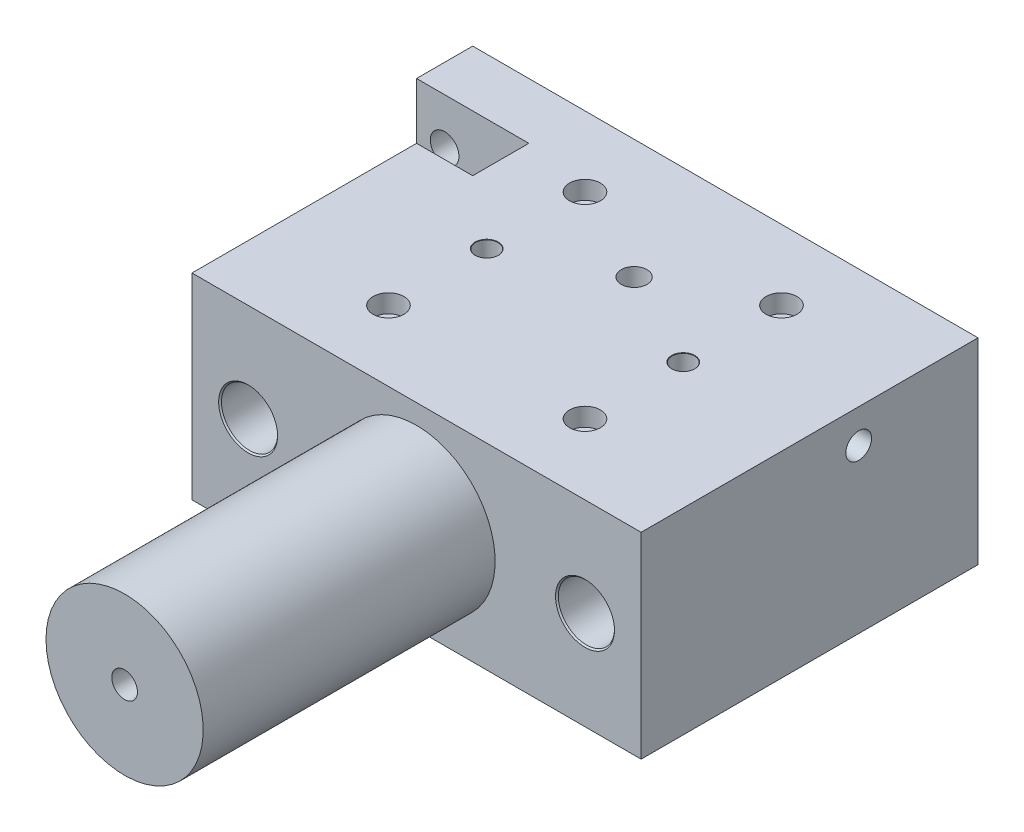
ISO-10303-21;
HEADER;
FILE_DESCRIPTION(('STEP AP214'),'2;1');
FILE_NAME('part.step','',(''),(''),'','','');
FILE_SCHEMA(('AUTOMOTIVE_DESIGN { 1 0 10303 214 1 1 1 1 }'));
ENDSEC;
DATA;
#1=APPLICATION_CONTEXT('core data for automotive mechanical design processes');
#2=APPLICATION_PROTOCOL_DEFINITION('international standard','automotive_design',2000,#1);
#3=PRODUCT_CONTEXT('',#1,'mechanical');
#4=PRODUCT('Part','Part','',(#3));
#5=PRODUCT_RELATED_PRODUCT_CATEGORY('part','',(#4));
#6=PRODUCT_DEFINITION_FORMATION('','',#4);
#7=PRODUCT_DEFINITION_CONTEXT('part definition',#1,'design');
#8=PRODUCT_DEFINITION('design','',#6,#7);
#9=PRODUCT_DEFINITION_SHAPE('','',#8);
#10=(LENGTH_UNIT() NAMED_UNIT(*) SI_UNIT(.MILLI.,.METRE.));
#11=(NAMED_UNIT(*) PLANE_ANGLE_UNIT() SI_UNIT($,.RADIAN.));
#12=(NAMED_UNIT(*) SI_UNIT($,.STERADIAN.) SOLID_ANGLE_UNIT());
#13=UNCERTAINTY_MEASURE_WITH_UNIT(LENGTH_MEASURE(1.E-05),#10,'distance_accuracy_value','');
#14=(GEOMETRIC_REPRESENTATION_CONTEXT(3) GLOBAL_UNCERTAINTY_ASSIGNED_CONTEXT((#13)) GLOBAL_UNIT_ASSIGNED_CONTEXT((#10,
#11,#12)) REPRESENTATION_CONTEXT('',''));
#15=CARTESIAN_POINT('',(0.,0.,0.));
#16=DIRECTION('',(0.,0.,1.));
#17=DIRECTION('',(1.,0.,0.));
#18=AXIS2_PLACEMENT_3D('',#15,#16,#17);
#19=CARTESIAN_POINT('',(0.,4.,-111.));
#20=DIRECTION('',(-1.,0.,0.));
#21=DIRECTION('',(0.,0.,1.));
#22=AXIS2_PLACEMENT_3D('',#19,#20,#21);
#23=CYLINDRICAL_SURFACE('',#22,2.39999999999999);
#24=CARTESIAN_POINT('',(8.99999999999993,4.,-111.));
#25=DIRECTION('',(-1.,0.,0.));
#26=DIRECTION('',(0.,0.,1.));
#27=AXIS2_PLACEMENT_3D('',#24,#25,#26);
#28=CIRCLE('',#27,2.39999999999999);
#29=CARTESIAN_POINT('',(8.99999999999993,4.,-108.6));
#30=VERTEX_POINT('',#29);
#31=EDGE_CURVE('E9355',#30,#30,#28,.T.);
#32=ORIENTED_EDGE('',*,*,#31,.F.);
#33=EDGE_LOOP('',(#32));
#34=FACE_BOUND('',#33,.T.);
#35=CARTESIAN_POINT('',(4.5,4.,-111.));
#36=DIRECTION('',(-1.,0.,0.));
#37=DIRECTION('',(0.,0.,1.));
#38=AXIS2_PLACEMENT_3D('',#35,#36,#37);
#39=CIRCLE('',#38,2.39999999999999);
#40=CARTESIAN_POINT('',(4.5,4.,-108.6));
#41=VERTEX_POINT('',#40);
#42=EDGE_CURVE('E9342',#41,#41,#39,.F.);
#43=ORIENTED_EDGE('',*,*,#42,.F.);
#44=EDGE_LOOP('',(#43));
#45=FACE_BOUND('',#44,.T.);
#46=ADVANCED_FACE('F9174',(#34,#45),#23,.F.);
#47=CARTESIAN_POINT('',(0.,70.,-120.));
#48=DIRECTION('',(1.,0.,0.));
#49=DIRECTION('',(0.,0.,-1.));
#50=AXIS2_PLACEMENT_3D('',#47,#48,#49);
#51=PLANE('',#50);
#52=CARTESIAN_POINT('',(0.,4.,-111.));
#53=DIRECTION('',(-1.,0.,0.));
#54=DIRECTION('',(0.,0.,1.));
#55=AXIS2_PLACEMENT_3D('',#52,#53,#54);
#56=CIRCLE('',#55,4.);
#57=CARTESIAN_POINT('',(0.,3.85832158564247,-107.002509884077));
#58=VERTEX_POINT('',#57);
#59=CARTESIAN_POINT('',(0.,4.,-115.));
#60=VERTEX_POINT('',#59);
#61=EDGE_CURVE('E9321',#58,#60,#56,.T.);
#62=ORIENTED_EDGE('',*,*,#61,.F.);
#63=DIRECTION('',(0.,1.,0.));
#64=VECTOR('',#63,1.);
#65=CARTESIAN_POINT('',(0.,3.85832158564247,-107.002509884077));
#66=LINE('',#65,#64);
#67=CARTESIAN_POINT('',(0.,0.,-107.002509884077));
#68=VERTEX_POINT('',#67);
#69=EDGE_CURVE('E9328',#68,#58,#66,.T.);
#70=ORIENTED_EDGE('',*,*,#69,.F.);
#71=DIRECTION('',(0.,0.,1.));
#72=VECTOR('',#71,1.);
#73=CARTESIAN_POINT('',(0.,0.,-120.));
#74=LINE('',#73,#72);
#75=CARTESIAN_POINT('',(0.,0.,-100.));
#76=VERTEX_POINT('',#75);
#77=EDGE_CURVE('E9548',#68,#76,#74,.T.);
#78=ORIENTED_EDGE('',*,*,#77,.T.);
#79=DIRECTION('',(0.,-1.,0.));
#80=VECTOR('',#79,1.);
#81=CARTESIAN_POINT('',(0.,70.,-100.));
#82=LINE('',#81,#80);
#83=CARTESIAN_POINT('',(0.,70.,-100.));
#84=VERTEX_POINT('',#83);
#85=EDGE_CURVE('E9580',#84,#76,#82,.T.);
#86=ORIENTED_EDGE('',*,*,#85,.F.);
#87=DIRECTION('',(0.,0.,1.));
#88=VECTOR('',#87,1.);
#89=CARTESIAN_POINT('',(0.,70.,-120.));
#90=LINE('',#89,#88);
#91=CARTESIAN_POINT('',(0.,70.,-120.));
#92=VERTEX_POINT('',#91);
#93=EDGE_CURVE('E9565',#92,#84,#90,.T.);
#94=ORIENTED_EDGE('',*,*,#93,.F.);
#95=DIRECTION('',(0.,-1.,0.));
#96=VECTOR('',#95,1.);
#97=CARTESIAN_POINT('',(0.,70.,-120.));
#98=LINE('',#97,#96);
#99=CARTESIAN_POINT('',(0.,0.,-120.));
#100=VERTEX_POINT('',#99);
#101=EDGE_CURVE('E9583',#92,#100,#98,.T.);
#102=ORIENTED_EDGE('',*,*,#101,.T.);
#103=CARTESIAN_POINT('',(0.,0.,-115.));
#104=VERTEX_POINT('',#103);
#105=EDGE_CURVE('E9549',#100,#104,#74,.T.);
#106=ORIENTED_EDGE('',*,*,#105,.T.);
#107=DIRECTION('',(0.,-1.,0.));
#108=VECTOR('',#107,1.);
#109=CARTESIAN_POINT('',(0.,4.,-115.));
#110=LINE('',#109,#108);
#111=EDGE_CURVE('E9326',#60,#104,#110,.T.);
#112=ORIENTED_EDGE('',*,*,#111,.F.);
#113=EDGE_LOOP('',(#62,#70,#78,#86,#94,#102,#106,#112));
#114=FACE_BOUND('',#113,.T.);
#115=ADVANCED_FACE('F9645',(#114),#51,.F.);
#116=CARTESIAN_POINT('',(180.,0.,-120.));
#117=DIRECTION('',(0.,-1.,0.));
#118=DIRECTION('',(0.,0.,-1.));
#119=AXIS2_PLACEMENT_3D('',#116,#117,#118);
#120=PLANE('',#119);
#121=DIRECTION('',(-1.,0.,0.));
#122=VECTOR('',#121,1.);
#123=CARTESIAN_POINT('',(4.5,0.,-107.002509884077));
#124=LINE('',#123,#122);
#125=CARTESIAN_POINT('',(4.5,0.,-107.002509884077));
#126=VERTEX_POINT('',#125);
#127=EDGE_CURVE('E9343',#126,#68,#124,.T.);
#128=ORIENTED_EDGE('',*,*,#127,.F.);
#129=DIRECTION('',(0.,0.,1.));
#130=VECTOR('',#129,1.);
#131=CARTESIAN_POINT('',(4.5,0.,-115.));
#132=LINE('',#131,#130);
#133=CARTESIAN_POINT('',(4.5,0.,-115.));
#134=VERTEX_POINT('',#133);
#135=EDGE_CURVE('E9334',#134,#126,#132,.T.);
#136=ORIENTED_EDGE('',*,*,#135,.F.);
#137=DIRECTION('',(-1.,0.,0.));
#138=VECTOR('',#137,1.);
#139=CARTESIAN_POINT('',(4.5,0.,-115.));
#140=LINE('',#139,#138);
#141=EDGE_CURVE('E9345',#134,#104,#140,.T.);
#142=ORIENTED_EDGE('',*,*,#141,.T.);
#143=ORIENTED_EDGE('',*,*,#105,.F.);
#144=DIRECTION('',(-1.,0.,0.));
#145=VECTOR('',#144,1.);
#146=CARTESIAN_POINT('',(0.,0.,-120.));
#147=LINE('',#146,#145);
#148=CARTESIAN_POINT('',(8.99999999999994,0.,-120.));
#149=VERTEX_POINT('',#148);
#150=EDGE_CURVE('E9544',#149,#100,#147,.T.);
#151=ORIENTED_EDGE('',*,*,#150,.F.);
#152=DIRECTION('',(0.,0.,-1.));
#153=VECTOR('',#152,1.);
#154=CARTESIAN_POINT('',(8.99999999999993,0.,-99.));
#155=LINE('',#154,#153);
#156=CARTESIAN_POINT('',(8.99999999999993,0.,-100.));
#157=VERTEX_POINT('',#156);
#158=EDGE_CURVE('E9358',#157,#149,#155,.T.);
#159=ORIENTED_EDGE('',*,*,#158,.F.);
#160=DIRECTION('',(1.,0.,0.));
#161=VECTOR('',#160,1.);
#162=CARTESIAN_POINT('',(0.,0.,-100.));
#163=LINE('',#162,#161);
#164=EDGE_CURVE('E9553',#76,#157,#163,.T.);
#165=ORIENTED_EDGE('',*,*,#164,.F.);
#166=ORIENTED_EDGE('',*,*,#77,.F.);
#167=EDGE_LOOP('',(#128,#136,#142,#143,#151,#159,#165,#166));
#168=FACE_BOUND('',#167,.T.);
#169=ADVANCED_FACE('F9652',(#168),#120,.T.);
#170=CARTESIAN_POINT('',(20.,70.,0.));
#171=DIRECTION('',(0.,0.,-1.));
#172=DIRECTION('',(-1.,0.,0.));
#173=AXIS2_PLACEMENT_3D('',#170,#171,#172);
#174=PLANE('',#173);
#175=DIRECTION('',(1.,0.,0.));
#176=VECTOR('',#175,1.);
#177=CARTESIAN_POINT('',(20.,0.,0.));
#178=LINE('',#177,#176);
#179=CARTESIAN_POINT('',(20.,0.,0.));
#180=VERTEX_POINT('',#179);
#181=CARTESIAN_POINT('',(180.,0.,0.));
#182=VERTEX_POINT('',#181);
#183=EDGE_CURVE('E9558',#180,#182,#178,.T.);
#184=ORIENTED_EDGE('',*,*,#183,.T.);
#185=DIRECTION('',(0.,-1.,0.));
#186=VECTOR('',#185,1.);
#187=CARTESIAN_POINT('',(180.,70.,0.));
#188=LINE('',#187,#186);
#189=CARTESIAN_POINT('',(180.,70.,0.));
#190=VERTEX_POINT('',#189);
#191=EDGE_CURVE('E9572',#190,#182,#188,.T.);
#192=ORIENTED_EDGE('',*,*,#191,.F.);
#193=DIRECTION('',(1.,0.,0.));
#194=VECTOR('',#193,1.);
#195=CARTESIAN_POINT('',(20.,70.,0.));
#196=LINE('',#195,#194);
#197=CARTESIAN_POINT('',(20.,70.,0.));
#198=VERTEX_POINT('',#197);
#199=EDGE_CURVE('E9570',#198,#190,#196,.T.);
#200=ORIENTED_EDGE('',*,*,#199,.F.);
#201=DIRECTION('',(0.,-1.,0.));
#202=VECTOR('',#201,1.);
#203=CARTESIAN_POINT('',(20.,70.,0.));
#204=LINE('',#203,#202);
#205=EDGE_CURVE('E9575',#198,#180,#204,.T.);
#206=ORIENTED_EDGE('',*,*,#205,.T.);
#207=EDGE_LOOP('',(#184,#192,#200,#206));
#208=FACE_BOUND('',#207,.T.);
#209=CARTESIAN_POINT('',(40.,35.,0.));
#210=DIRECTION('',(0.,0.,1.));
#211=DIRECTION('',(1.,0.,0.));
#212=AXIS2_PLACEMENT_3D('',#209,#210,#211);
#213=CIRCLE('',#212,10.5);
#214=CARTESIAN_POINT('',(50.5,35.,0.));
#215=VERTEX_POINT('',#214);
#216=EDGE_CURVE('E9526',#215,#215,#213,.T.);
#217=ORIENTED_EDGE('',*,*,#216,.F.);
#218=EDGE_LOOP('',(#217));
#219=FACE_BOUND('',#218,.T.);
#220=CARTESIAN_POINT('',(160.,35.,0.));
#221=DIRECTION('',(0.,0.,1.));
#222=DIRECTION('',(1.,0.,0.));
#223=AXIS2_PLACEMENT_3D('',#220,#221,#222);
#224=CIRCLE('',#223,10.5);
#225=CARTESIAN_POINT('',(170.5,35.,0.));
#226=VERTEX_POINT('',#225);
#227=EDGE_CURVE('E9514',#226,#226,#224,.T.);
#228=ORIENTED_EDGE('',*,*,#227,.F.);
#229=EDGE_LOOP('',(#228));
#230=FACE_BOUND('',#229,.T.);
#231=CARTESIAN_POINT('',(100.,35.,0.));
#232=DIRECTION('',(0.,0.,-1.));
#233=DIRECTION('',(-1.,0.,0.));
#234=AXIS2_PLACEMENT_3D('',#231,#232,#233);
#235=CIRCLE('',#234,28.);
#236=CARTESIAN_POINT('',(72.,35.,0.));
#237=VERTEX_POINT('',#236);
#238=EDGE_CURVE('E9589',#237,#237,#235,.F.);
#239=ORIENTED_EDGE('',*,*,#238,.F.);
#240=EDGE_LOOP('',(#239));
#241=FACE_BOUND('',#240,.T.);
#242=ADVANCED_FACE('F9626',(#208,#219,#230,#241),#174,.F.);
#243=DIRECTION('',(0.,0.,1.));
#244=VECTOR('',#243,1.);
#245=CARTESIAN_POINT('',(10.9999999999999,0.,-99.));
#246=LINE('',#245,#244);
#247=CARTESIAN_POINT('',(10.9999999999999,0.,-120.));
#248=VERTEX_POINT('',#247);
#249=CARTESIAN_POINT('',(10.9999999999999,0.,-100.));
#250=VERTEX_POINT('',#249);
#251=EDGE_CURVE('E9360',#248,#250,#246,.T.);
#252=ORIENTED_EDGE('',*,*,#251,.F.);
#253=CARTESIAN_POINT('',(180.,0.,-120.));
#254=VERTEX_POINT('',#253);
#255=EDGE_CURVE('E9545',#254,#248,#147,.T.);
#256=ORIENTED_EDGE('',*,*,#255,.F.);
#257=DIRECTION('',(0.,0.,-1.));
#258=VECTOR('',#257,1.);
#259=CARTESIAN_POINT('',(180.,0.,0.));
#260=LINE('',#259,#258);
#261=EDGE_CURVE('E9541',#182,#254,#260,.T.);
#262=ORIENTED_EDGE('',*,*,#261,.F.);
#263=ORIENTED_EDGE('',*,*,#183,.F.);
#264=DIRECTION('',(0.,0.,1.));
#265=VECTOR('',#264,1.);
#266=CARTESIAN_POINT('',(19.9999999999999,0.,-100.));
#267=LINE('',#266,#265);
#268=CARTESIAN_POINT('',(19.9999999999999,0.,-100.));
#269=VERTEX_POINT('',#268);
#270=EDGE_CURVE('E9556',#269,#180,#267,.T.);
#271=ORIENTED_EDGE('',*,*,#270,.F.);
#272=EDGE_CURVE('E9552',#250,#269,#163,.T.);
#273=ORIENTED_EDGE('',*,*,#272,.F.);
#274=EDGE_LOOP('',(#252,#256,#262,#263,#271,#273));
#275=FACE_BOUND('',#274,.T.);
#276=CARTESIAN_POINT('',(100.,0.,-77.5));
#277=DIRECTION('',(0.,-1.,0.));
#278=DIRECTION('',(0.,0.,-1.));
#279=AXIS2_PLACEMENT_3D('',#276,#277,#278);
#280=CIRCLE('',#279,4.57349999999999);
#281=CARTESIAN_POINT('',(100.,0.,-82.0735));
#282=VERTEX_POINT('',#281);
#283=EDGE_CURVE('E9422',#282,#282,#280,.T.);
#284=ORIENTED_EDGE('',*,*,#283,.F.);
#285=EDGE_LOOP('',(#284));
#286=FACE_BOUND('',#285,.T.);
#287=CARTESIAN_POINT('',(65.,0.,-25.));
#288=DIRECTION('',(0.,-1.,0.));
#289=DIRECTION('',(0.,0.,-1.));
#290=AXIS2_PLACEMENT_3D('',#287,#288,#289);
#291=CIRCLE('',#290,5.50000000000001);
#292=CARTESIAN_POINT('',(65.,0.,-30.5));
#293=VERTEX_POINT('',#292);
#294=EDGE_CURVE('E9428',#293,#293,#291,.T.);
#295=ORIENTED_EDGE('',*,*,#294,.F.);
#296=EDGE_LOOP('',(#295));
#297=FACE_BOUND('',#296,.T.);
#298=CARTESIAN_POINT('',(65.,0.,-95.));
#299=DIRECTION('',(0.,-1.,0.));
#300=DIRECTION('',(0.,0.,-1.));
#301=AXIS2_PLACEMENT_3D('',#298,#299,#300);
#302=CIRCLE('',#301,5.50000000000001);
#303=CARTESIAN_POINT('',(65.,0.,-100.5));
#304=VERTEX_POINT('',#303);
#305=EDGE_CURVE('E9456',#304,#304,#302,.T.);
#306=ORIENTED_EDGE('',*,*,#305,.F.);
#307=EDGE_LOOP('',(#306));
#308=FACE_BOUND('',#307,.T.);
#309=CARTESIAN_POINT('',(135.,0.,-60.));
#310=DIRECTION('',(0.,-1.,0.));
#311=DIRECTION('',(0.,0.,-1.));
#312=AXIS2_PLACEMENT_3D('',#309,#310,#311);
#313=CIRCLE('',#312,4.12499999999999);
#314=CARTESIAN_POINT('',(135.,0.,-64.125));
#315=VERTEX_POINT('',#314);
#316=EDGE_CURVE('E9490',#315,#315,#313,.T.);
#317=ORIENTED_EDGE('',*,*,#316,.F.);
#318=EDGE_LOOP('',(#317));
#319=FACE_BOUND('',#318,.T.);
#320=CARTESIAN_POINT('',(65.,0.,-60.));
#321=DIRECTION('',(0.,-1.,0.));
#322=DIRECTION('',(0.,0.,-1.));
#323=AXIS2_PLACEMENT_3D('',#320,#321,#322);
#324=CIRCLE('',#323,4.125);
#325=CARTESIAN_POINT('',(65.,0.,-64.125));
#326=VERTEX_POINT('',#325);
#327=EDGE_CURVE('E9502',#326,#326,#324,.T.);
#328=ORIENTED_EDGE('',*,*,#327,.F.);
#329=EDGE_LOOP('',(#328));
#330=FACE_BOUND('',#329,.T.);
#331=CARTESIAN_POINT('',(135.,0.,-95.));
#332=DIRECTION('',(0.,-1.,0.));
#333=DIRECTION('',(0.,0.,-1.));
#334=AXIS2_PLACEMENT_3D('',#331,#332,#333);
#335=CIRCLE('',#334,5.50000000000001);
#336=CARTESIAN_POINT('',(135.,0.,-100.5));
#337=VERTEX_POINT('',#336);
#338=EDGE_CURVE('E9470',#337,#337,#335,.T.);
#339=ORIENTED_EDGE('',*,*,#338,.F.);
#340=EDGE_LOOP('',(#339));
#341=FACE_BOUND('',#340,.T.);
#342=CARTESIAN_POINT('',(135.,0.,-25.));
#343=DIRECTION('',(0.,-1.,0.));
#344=DIRECTION('',(0.,0.,-1.));
#345=AXIS2_PLACEMENT_3D('',#342,#343,#344);
#346=CIRCLE('',#345,5.50000000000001);
#347=CARTESIAN_POINT('',(135.,0.,-30.5));
#348=VERTEX_POINT('',#347);
#349=EDGE_CURVE('E9442',#348,#348,#346,.T.);
#350=ORIENTED_EDGE('',*,*,#349,.F.);
#351=EDGE_LOOP('',(#350));
#352=FACE_BOUND('',#351,.T.);
#353=ADVANCED_FACE('F9631',(#275,#286,#297,#308,#319,#330,#341,#352),#120,.T.);
#354=CARTESIAN_POINT('',(180.,70.,0.));
#355=DIRECTION('',(-1.,0.,0.));
#356=DIRECTION('',(0.,0.,1.));
#357=AXIS2_PLACEMENT_3D('',#354,#355,#356);
#358=PLANE('',#357);
#359=CARTESIAN_POINT('',(180.,58.,-77.5));
#360=DIRECTION('',(1.,0.,0.));
#361=DIRECTION('',(0.,0.,-1.));
#362=AXIS2_PLACEMENT_3D('',#359,#360,#361);
#363=CIRCLE('',#362,4.57349999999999);
#364=CARTESIAN_POINT('',(180.,58.,-82.0735));
#365=VERTEX_POINT('',#364);
#366=EDGE_CURVE('E9398',#365,#365,#363,.T.);
#367=ORIENTED_EDGE('',*,*,#366,.F.);
#368=EDGE_LOOP('',(#367));
#369=FACE_BOUND('',#368,.T.);
#370=ORIENTED_EDGE('',*,*,#261,.T.);
#371=DIRECTION('',(0.,-1.,0.));
#372=VECTOR('',#371,1.);
#373=CARTESIAN_POINT('',(180.,70.,-120.));
#374=LINE('',#373,#372);
#375=CARTESIAN_POINT('',(180.,70.,-120.));
#376=VERTEX_POINT('',#375);
#377=EDGE_CURVE('E9586',#376,#254,#374,.T.);
#378=ORIENTED_EDGE('',*,*,#377,.F.);
#379=DIRECTION('',(0.,0.,-1.));
#380=VECTOR('',#379,1.);
#381=CARTESIAN_POINT('',(180.,70.,0.));
#382=LINE('',#381,#380);
#383=EDGE_CURVE('E9560',#190,#376,#382,.T.);
#384=ORIENTED_EDGE('',*,*,#383,.F.);
#385=ORIENTED_EDGE('',*,*,#191,.T.);
#386=EDGE_LOOP('',(#370,#378,#384,#385));
#387=FACE_BOUND('',#386,.T.);
#388=ADVANCED_FACE('F9176',(#369,#387),#358,.F.);
#389=CARTESIAN_POINT('',(0.,70.,-120.));
#390=DIRECTION('',(0.,0.,1.));
#391=DIRECTION('',(1.,0.,0.));
#392=AXIS2_PLACEMENT_3D('',#389,#390,#391);
#393=PLANE('',#392);
#394=CARTESIAN_POINT('',(160.,35.,-120.));
#395=DIRECTION('',(0.,0.,1.));
#396=DIRECTION('',(1.,0.,0.));
#397=AXIS2_PLACEMENT_3D('',#394,#395,#396);
#398=CIRCLE('',#397,10.5);
#399=CARTESIAN_POINT('',(170.5,35.,-120.));
#400=VERTEX_POINT('',#399);
#401=EDGE_CURVE('E9505',#400,#400,#398,.T.);
#402=ORIENTED_EDGE('',*,*,#401,.T.);
#403=EDGE_LOOP('',(#402));
#404=FACE_BOUND('',#403,.T.);
#405=CARTESIAN_POINT('',(40.,35.,-120.));
#406=DIRECTION('',(0.,0.,1.));
#407=DIRECTION('',(1.,0.,0.));
#408=AXIS2_PLACEMENT_3D('',#405,#406,#407);
#409=CIRCLE('',#408,10.5);
#410=CARTESIAN_POINT('',(50.5,35.,-120.));
#411=VERTEX_POINT('',#410);
#412=EDGE_CURVE('E9517',#411,#411,#409,.T.);
#413=ORIENTED_EDGE('',*,*,#412,.T.);
#414=EDGE_LOOP('',(#413));
#415=FACE_BOUND('',#414,.T.);
#416=CARTESIAN_POINT('',(9.99999999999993,53.5,-120.));
#417=DIRECTION('',(0.,0.,1.));
#418=DIRECTION('',(1.,0.,0.));
#419=AXIS2_PLACEMENT_3D('',#416,#417,#418);
#420=CIRCLE('',#419,5.1);
#421=CARTESIAN_POINT('',(15.0999999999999,53.5,-120.));
#422=VERTEX_POINT('',#421);
#423=EDGE_CURVE('E9529',#422,#422,#420,.T.);
#424=ORIENTED_EDGE('',*,*,#423,.T.);
#425=EDGE_LOOP('',(#424));
#426=FACE_BOUND('',#425,.T.);
#427=CARTESIAN_POINT('',(9.99999999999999,13.5,-120.));
#428=DIRECTION('',(0.,0.,1.));
#429=DIRECTION('',(1.,0.,0.));
#430=AXIS2_PLACEMENT_3D('',#427,#428,#429);
#431=CIRCLE('',#430,6.);
#432=CARTESIAN_POINT('',(10.9999999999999,7.58392021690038,-120.));
#433=VERTEX_POINT('',#432);
#434=CARTESIAN_POINT('',(8.99999999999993,7.5839202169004,-120.));
#435=VERTEX_POINT('',#434);
#436=EDGE_CURVE('E9535',#433,#435,#431,.T.);
#437=ORIENTED_EDGE('',*,*,#436,.T.);
#438=DIRECTION('',(0.,-1.,0.));
#439=VECTOR('',#438,1.);
#440=CARTESIAN_POINT('',(8.99999999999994,70.,-120.));
#441=LINE('',#440,#439);
#442=EDGE_CURVE('E9371',#435,#149,#441,.T.);
#443=ORIENTED_EDGE('',*,*,#442,.T.);
#444=ORIENTED_EDGE('',*,*,#150,.T.);
#445=ORIENTED_EDGE('',*,*,#101,.F.);
#446=DIRECTION('',(-1.,0.,0.));
#447=VECTOR('',#446,1.);
#448=CARTESIAN_POINT('',(0.,70.,-120.));
#449=LINE('',#448,#447);
#450=EDGE_CURVE('E9563',#376,#92,#449,.T.);
#451=ORIENTED_EDGE('',*,*,#450,.F.);
#452=ORIENTED_EDGE('',*,*,#377,.T.);
#453=ORIENTED_EDGE('',*,*,#255,.T.);
#454=DIRECTION('',(0.,1.,0.));
#455=VECTOR('',#454,1.);
#456=CARTESIAN_POINT('',(10.9999999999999,70.,-120.));
#457=LINE('',#456,#455);
#458=EDGE_CURVE('E9365',#248,#433,#457,.T.);
#459=ORIENTED_EDGE('',*,*,#458,.T.);
#460=EDGE_LOOP('',(#437,#443,#444,#445,#451,#452,#453,#459));
#461=FACE_BOUND('',#460,.T.);
#462=ADVANCED_FACE('F9640',(#404,#415,#426,#461),#393,.F.);
#463=CARTESIAN_POINT('',(0.,70.,-100.));
#464=DIRECTION('',(0.,0.,-1.));
#465=DIRECTION('',(-1.,0.,0.));
#466=AXIS2_PLACEMENT_3D('',#463,#464,#465);
#467=PLANE('',#466);
#468=CARTESIAN_POINT('',(9.99999999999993,53.5,-100.));
#469=DIRECTION('',(0.,0.,1.));
#470=DIRECTION('',(1.,0.,0.));
#471=AXIS2_PLACEMENT_3D('',#468,#469,#470);
#472=CIRCLE('',#471,5.1);
#473=CARTESIAN_POINT('',(15.0999999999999,53.5,-100.));
#474=VERTEX_POINT('',#473);
#475=EDGE_CURVE('E9532',#474,#474,#472,.T.);
#476=ORIENTED_EDGE('',*,*,#475,.F.);
#477=EDGE_LOOP('',(#476));
#478=FACE_BOUND('',#477,.T.);
#479=DIRECTION('',(0.,-1.,0.));
#480=VECTOR('',#479,1.);
#481=CARTESIAN_POINT('',(19.9999999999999,70.,-100.));
#482=LINE('',#481,#480);
#483=CARTESIAN_POINT('',(19.9999999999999,50.,-100.));
#484=VERTEX_POINT('',#483);
#485=EDGE_CURVE('E9578',#484,#269,#482,.T.);
#486=ORIENTED_EDGE('',*,*,#485,.F.);
#487=DIRECTION('',(-0.707106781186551,-0.707106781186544,0.));
#488=VECTOR('',#487,1.);
#489=CARTESIAN_POINT('',(19.9999999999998,50.,-100.));
#490=LINE('',#489,#488);
#491=CARTESIAN_POINT('',(39.9999999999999,70.,-100.));
#492=VERTEX_POINT('',#491);
#493=EDGE_CURVE('E9182',#484,#492,#490,.F.);
#494=ORIENTED_EDGE('',*,*,#493,.T.);
#495=DIRECTION('',(1.,0.,0.));
#496=VECTOR('',#495,1.);
#497=CARTESIAN_POINT('',(0.,70.,-100.));
#498=LINE('',#497,#496);
#499=EDGE_CURVE('E9311',#84,#492,#498,.T.);
#500=ORIENTED_EDGE('',*,*,#499,.F.);
#501=ORIENTED_EDGE('',*,*,#85,.T.);
#502=ORIENTED_EDGE('',*,*,#164,.T.);
#503=DIRECTION('',(0.,1.,0.));
#504=VECTOR('',#503,1.);
#505=CARTESIAN_POINT('',(8.99999999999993,70.,-100.));
#506=LINE('',#505,#504);
#507=CARTESIAN_POINT('',(8.99999999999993,7.58392021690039,-100.));
#508=VERTEX_POINT('',#507);
#509=EDGE_CURVE('E9368',#157,#508,#506,.T.);
#510=ORIENTED_EDGE('',*,*,#509,.T.);
#511=CARTESIAN_POINT('',(9.99999999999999,13.5,-100.));
#512=DIRECTION('',(0.,0.,1.));
#513=DIRECTION('',(1.,0.,0.));
#514=AXIS2_PLACEMENT_3D('',#511,#512,#513);
#515=CIRCLE('',#514,6.);
#516=CARTESIAN_POINT('',(10.9999999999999,7.58392021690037,-100.));
#517=VERTEX_POINT('',#516);
#518=EDGE_CURVE('E9538',#517,#508,#515,.T.);
#519=ORIENTED_EDGE('',*,*,#518,.F.);
#520=DIRECTION('',(0.,-1.,0.));
#521=VECTOR('',#520,1.);
#522=CARTESIAN_POINT('',(10.9999999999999,70.,-100.));
#523=LINE('',#522,#521);
#524=EDGE_CURVE('E9362',#517,#250,#523,.T.);
#525=ORIENTED_EDGE('',*,*,#524,.T.);
#526=ORIENTED_EDGE('',*,*,#272,.T.);
#527=EDGE_LOOP('',(#486,#494,#500,#501,#502,#510,#519,#525,#526));
#528=FACE_BOUND('',#527,.T.);
#529=ADVANCED_FACE('F9616',(#478,#528),#467,.F.);
#530=CARTESIAN_POINT('',(19.9999999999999,70.,-100.));
#531=DIRECTION('',(1.,0.,0.));
#532=DIRECTION('',(0.,0.,-1.));
#533=AXIS2_PLACEMENT_3D('',#530,#531,#532);
#534=PLANE('',#533);
#535=DIRECTION('',(0.,0.,1.));
#536=VECTOR('',#535,1.);
#537=CARTESIAN_POINT('',(19.9999999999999,70.,-100.));
#538=LINE('',#537,#536);
#539=CARTESIAN_POINT('',(19.9999999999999,70.,-80.));
#540=VERTEX_POINT('',#539);
#541=EDGE_CURVE('E9568',#540,#198,#538,.T.);
#542=ORIENTED_EDGE('',*,*,#541,.F.);
#543=DIRECTION('',(0.,1.,0.));
#544=VECTOR('',#543,1.);
#545=CARTESIAN_POINT('',(19.9999999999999,50.,-80.));
#546=LINE('',#545,#544);
#547=CARTESIAN_POINT('',(19.9999999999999,50.,-80.));
#548=VERTEX_POINT('',#547);
#549=EDGE_CURVE('E9188',#548,#540,#546,.T.);
#550=ORIENTED_EDGE('',*,*,#549,.F.);
#551=DIRECTION('',(0.,0.,1.));
#552=VECTOR('',#551,1.);
#553=CARTESIAN_POINT('',(19.9999999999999,50.,-80.));
#554=LINE('',#553,#552);
#555=EDGE_CURVE('E9313',#484,#548,#554,.T.);
#556=ORIENTED_EDGE('',*,*,#555,.F.);
#557=ORIENTED_EDGE('',*,*,#485,.T.);
#558=ORIENTED_EDGE('',*,*,#270,.T.);
#559=ORIENTED_EDGE('',*,*,#205,.F.);
#560=EDGE_LOOP('',(#542,#550,#556,#557,#558,#559));
#561=FACE_BOUND('',#560,.T.);
#562=ADVANCED_FACE('F9620',(#561),#534,.F.);
#563=CARTESIAN_POINT('',(180.,70.,-120.));
#564=DIRECTION('',(0.,-1.,0.));
#565=DIRECTION('',(0.,0.,-1.));
#566=AXIS2_PLACEMENT_3D('',#563,#564,#565);
#567=PLANE('',#566);
#568=CARTESIAN_POINT('',(100.,70.,-77.5));
#569=DIRECTION('',(0.,1.,0.));
#570=DIRECTION('',(0.,0.,1.));
#571=AXIS2_PLACEMENT_3D('',#568,#569,#570);
#572=CIRCLE('',#571,4.57349999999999);
#573=CARTESIAN_POINT('',(100.,70.,-72.9265));
#574=VERTEX_POINT('',#573);
#575=EDGE_CURVE('E9401',#574,#574,#572,.T.);
#576=ORIENTED_EDGE('',*,*,#575,.F.);
#577=EDGE_LOOP('',(#576));
#578=FACE_BOUND('',#577,.T.);
#579=CARTESIAN_POINT('',(65.,70.,-25.));
#580=DIRECTION('',(0.,1.,0.));
#581=DIRECTION('',(0.,0.,1.));
#582=AXIS2_PLACEMENT_3D('',#579,#580,#581);
#583=CIRCLE('',#582,5.50000000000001);
#584=CARTESIAN_POINT('',(65.,70.,-19.5));
#585=VERTEX_POINT('',#584);
#586=EDGE_CURVE('E9435',#585,#585,#583,.T.);
#587=ORIENTED_EDGE('',*,*,#586,.F.);
#588=EDGE_LOOP('',(#587));
#589=FACE_BOUND('',#588,.T.);
#590=CARTESIAN_POINT('',(135.,70.,-25.));
#591=DIRECTION('',(0.,1.,0.));
#592=DIRECTION('',(0.,0.,1.));
#593=AXIS2_PLACEMENT_3D('',#590,#591,#592);
#594=CIRCLE('',#593,5.50000000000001);
#595=CARTESIAN_POINT('',(135.,70.,-19.5));
#596=VERTEX_POINT('',#595);
#597=EDGE_CURVE('E9449',#596,#596,#594,.T.);
#598=ORIENTED_EDGE('',*,*,#597,.F.);
#599=EDGE_LOOP('',(#598));
#600=FACE_BOUND('',#599,.T.);
#601=CARTESIAN_POINT('',(65.,70.,-95.));
#602=DIRECTION('',(0.,1.,0.));
#603=DIRECTION('',(0.,0.,1.));
#604=AXIS2_PLACEMENT_3D('',#601,#602,#603);
#605=CIRCLE('',#604,5.50000000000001);
#606=CARTESIAN_POINT('',(65.,70.,-89.5));
#607=VERTEX_POINT('',#606);
#608=EDGE_CURVE('E9463',#607,#607,#605,.T.);
#609=ORIENTED_EDGE('',*,*,#608,.F.);
#610=EDGE_LOOP('',(#609));
#611=FACE_BOUND('',#610,.T.);
#612=CARTESIAN_POINT('',(135.,70.,-95.));
#613=DIRECTION('',(0.,1.,0.));
#614=DIRECTION('',(0.,0.,1.));
#615=AXIS2_PLACEMENT_3D('',#612,#613,#614);
#616=CIRCLE('',#615,5.50000000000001);
#617=CARTESIAN_POINT('',(135.,70.,-89.5));
#618=VERTEX_POINT('',#617);
#619=EDGE_CURVE('E9477',#618,#618,#616,.T.);
#620=ORIENTED_EDGE('',*,*,#619,.F.);
#621=EDGE_LOOP('',(#620));
#622=FACE_BOUND('',#621,.T.);
#623=CARTESIAN_POINT('',(135.,70.,-60.));
#624=DIRECTION('',(0.,-1.,0.));
#625=DIRECTION('',(0.,0.,-1.));
#626=AXIS2_PLACEMENT_3D('',#623,#624,#625);
#627=CIRCLE('',#626,4.12499999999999);
#628=CARTESIAN_POINT('',(135.,70.,-64.125));
#629=VERTEX_POINT('',#628);
#630=EDGE_CURVE('E9481',#629,#629,#627,.T.);
#631=ORIENTED_EDGE('',*,*,#630,.T.);
#632=EDGE_LOOP('',(#631));
#633=FACE_BOUND('',#632,.T.);
#634=CARTESIAN_POINT('',(65.,70.,-60.));
#635=DIRECTION('',(0.,-1.,0.));
#636=DIRECTION('',(0.,0.,-1.));
#637=AXIS2_PLACEMENT_3D('',#634,#635,#636);
#638=CIRCLE('',#637,4.12499999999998);
#639=CARTESIAN_POINT('',(65.,70.,-64.125));
#640=VERTEX_POINT('',#639);
#641=EDGE_CURVE('E9493',#640,#640,#638,.T.);
#642=ORIENTED_EDGE('',*,*,#641,.T.);
#643=EDGE_LOOP('',(#642));
#644=FACE_BOUND('',#643,.T.);
#645=ORIENTED_EDGE('',*,*,#499,.T.);
#646=DIRECTION('',(0.,0.,-1.));
#647=VECTOR('',#646,1.);
#648=CARTESIAN_POINT('',(39.9999999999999,70.,-100.));
#649=LINE('',#648,#647);
#650=CARTESIAN_POINT('',(39.9999999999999,70.,-80.));
#651=VERTEX_POINT('',#650);
#652=EDGE_CURVE('E9305',#651,#492,#649,.T.);
#653=ORIENTED_EDGE('',*,*,#652,.F.);
#654=DIRECTION('',(1.,0.,0.));
#655=VECTOR('',#654,1.);
#656=CARTESIAN_POINT('',(39.9999999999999,70.,-80.));
#657=LINE('',#656,#655);
#658=EDGE_CURVE('E9299',#540,#651,#657,.T.);
#659=ORIENTED_EDGE('',*,*,#658,.F.);
#660=ORIENTED_EDGE('',*,*,#541,.T.);
#661=ORIENTED_EDGE('',*,*,#199,.T.);
#662=ORIENTED_EDGE('',*,*,#383,.T.);
#663=ORIENTED_EDGE('',*,*,#450,.T.);
#664=ORIENTED_EDGE('',*,*,#93,.T.);
#665=EDGE_LOOP('',(#645,#653,#659,#660,#661,#662,#663,#664));
#666=FACE_BOUND('',#665,.T.);
#667=ADVANCED_FACE('F9309',(#578,#589,#600,#611,#622,#633,#644,#666),#567,.F.);
#668=CARTESIAN_POINT('',(9.99999999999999,13.5,-100.));
#669=DIRECTION('',(0.,0.,1.));
#670=DIRECTION('',(1.,0.,0.));
#671=AXIS2_PLACEMENT_3D('',#668,#669,#670);
#672=CYLINDRICAL_SURFACE('',#671,6.);
#673=ORIENTED_EDGE('',*,*,#518,.T.);
#674=DIRECTION('',(0.,0.,1.));
#675=VECTOR('',#674,1.);
#676=CARTESIAN_POINT('',(8.99999999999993,7.58392021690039,-100.));
#677=LINE('',#676,#675);
#678=EDGE_CURVE('E9611',#508,#435,#677,.F.);
#679=ORIENTED_EDGE('',*,*,#678,.T.);
#680=ORIENTED_EDGE('',*,*,#436,.F.);
#681=DIRECTION('',(0.,0.,1.));
#682=VECTOR('',#681,1.);
#683=CARTESIAN_POINT('',(10.9999999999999,7.58392021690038,-100.));
#684=LINE('',#683,#682);
#685=EDGE_CURVE('E9608',#433,#517,#684,.T.);
#686=ORIENTED_EDGE('',*,*,#685,.T.);
#687=EDGE_LOOP('',(#673,#679,#680,#686));
#688=FACE_BOUND('',#687,.T.);
#689=ADVANCED_FACE('F9657',(#688),#672,.F.);
#690=CARTESIAN_POINT('',(9.99999999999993,53.5,-100.));
#691=DIRECTION('',(0.,0.,1.));
#692=DIRECTION('',(1.,0.,0.));
#693=AXIS2_PLACEMENT_3D('',#690,#691,#692);
#694=CYLINDRICAL_SURFACE('',#693,5.1);
#695=ORIENTED_EDGE('',*,*,#423,.F.);
#696=EDGE_LOOP('',(#695));
#697=FACE_BOUND('',#696,.T.);
#698=ORIENTED_EDGE('',*,*,#475,.T.);
#699=EDGE_LOOP('',(#698));
#700=FACE_BOUND('',#699,.T.);
#701=ADVANCED_FACE('F9789',(#697,#700),#694,.F.);
#702=CARTESIAN_POINT('',(40.,35.,0.));
#703=DIRECTION('',(0.,0.,1.));
#704=DIRECTION('',(1.,0.,0.));
#705=AXIS2_PLACEMENT_3D('',#702,#703,#704);
#706=CONICAL_SURFACE('',#705,10.5,0.785398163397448);
#707=CARTESIAN_POINT('',(40.,35.,-0.500000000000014));
#708=DIRECTION('',(0.,0.,1.));
#709=DIRECTION('',(1.,0.,0.));
#710=AXIS2_PLACEMENT_3D('',#707,#708,#709);
#711=CIRCLE('',#710,9.99999999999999);
#712=CARTESIAN_POINT('',(50.,35.,-0.500000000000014));
#713=VERTEX_POINT('',#712);
#714=EDGE_CURVE('E9523',#713,#713,#711,.T.);
#715=ORIENTED_EDGE('',*,*,#714,.F.);
#716=EDGE_LOOP('',(#715));
#717=FACE_BOUND('',#716,.T.);
#718=ORIENTED_EDGE('',*,*,#216,.T.);
#719=EDGE_LOOP('',(#718));
#720=FACE_BOUND('',#719,.T.);
#721=ADVANCED_FACE('F10199',(#717,#720),#706,.F.);
#722=CARTESIAN_POINT('',(40.,35.,0.));
#723=DIRECTION('',(0.,0.,1.));
#724=DIRECTION('',(1.,0.,0.));
#725=AXIS2_PLACEMENT_3D('',#722,#723,#724);
#726=CYLINDRICAL_SURFACE('',#725,9.99999999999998);
#727=CARTESIAN_POINT('',(40.,35.,-119.5));
#728=DIRECTION('',(0.,0.,1.));
#729=DIRECTION('',(1.,0.,0.));
#730=AXIS2_PLACEMENT_3D('',#727,#728,#729);
#731=CIRCLE('',#730,9.99999999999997);
#732=CARTESIAN_POINT('',(50.,35.,-119.5));
#733=VERTEX_POINT('',#732);
#734=EDGE_CURVE('E9520',#733,#733,#731,.T.);
#735=ORIENTED_EDGE('',*,*,#734,.F.);
#736=EDGE_LOOP('',(#735));
#737=FACE_BOUND('',#736,.T.);
#738=ORIENTED_EDGE('',*,*,#714,.T.);
#739=EDGE_LOOP('',(#738));
#740=FACE_BOUND('',#739,.T.);
#741=ADVANCED_FACE('F10191',(#737,#740),#726,.F.);
#742=CARTESIAN_POINT('',(40.,35.,-119.5));
#743=DIRECTION('',(0.,0.,-1.));
#744=DIRECTION('',(-1.,0.,0.));
#745=AXIS2_PLACEMENT_3D('',#742,#743,#744);
#746=CONICAL_SURFACE('',#745,9.99999999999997,0.785398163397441);
#747=ORIENTED_EDGE('',*,*,#412,.F.);
#748=EDGE_LOOP('',(#747));
#749=FACE_BOUND('',#748,.T.);
#750=ORIENTED_EDGE('',*,*,#734,.T.);
#751=EDGE_LOOP('',(#750));
#752=FACE_BOUND('',#751,.T.);
#753=ADVANCED_FACE('F10183',(#749,#752),#746,.F.);
#754=CARTESIAN_POINT('',(160.,35.,0.));
#755=DIRECTION('',(0.,0.,1.));
#756=DIRECTION('',(1.,0.,0.));
#757=AXIS2_PLACEMENT_3D('',#754,#755,#756);
#758=CONICAL_SURFACE('',#757,10.5,0.785398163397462);
#759=CARTESIAN_POINT('',(160.,35.,-0.500000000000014));
#760=DIRECTION('',(0.,0.,1.));
#761=DIRECTION('',(1.,0.,0.));
#762=AXIS2_PLACEMENT_3D('',#759,#760,#761);
#763=CIRCLE('',#762,9.99999999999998);
#764=CARTESIAN_POINT('',(170.,35.,-0.500000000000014));
#765=VERTEX_POINT('',#764);
#766=EDGE_CURVE('E9511',#765,#765,#763,.T.);
#767=ORIENTED_EDGE('',*,*,#766,.F.);
#768=EDGE_LOOP('',(#767));
#769=FACE_BOUND('',#768,.T.);
#770=ORIENTED_EDGE('',*,*,#227,.T.);
#771=EDGE_LOOP('',(#770));
#772=FACE_BOUND('',#771,.T.);
#773=ADVANCED_FACE('F10175',(#769,#772),#758,.F.);
#774=CARTESIAN_POINT('',(160.,35.,0.));
#775=DIRECTION('',(0.,0.,1.));
#776=DIRECTION('',(1.,0.,0.));
#777=AXIS2_PLACEMENT_3D('',#774,#775,#776);
#778=CYLINDRICAL_SURFACE('',#777,9.99999999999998);
#779=CARTESIAN_POINT('',(160.,35.,-119.5));
#780=DIRECTION('',(0.,0.,1.));
#781=DIRECTION('',(1.,0.,0.));
#782=AXIS2_PLACEMENT_3D('',#779,#780,#781);
#783=CIRCLE('',#782,9.99999999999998);
#784=CARTESIAN_POINT('',(170.,35.,-119.5));
#785=VERTEX_POINT('',#784);
#786=EDGE_CURVE('E9508',#785,#785,#783,.T.);
#787=ORIENTED_EDGE('',*,*,#786,.F.);
#788=EDGE_LOOP('',(#787));
#789=FACE_BOUND('',#788,.T.);
#790=ORIENTED_EDGE('',*,*,#766,.T.);
#791=EDGE_LOOP('',(#790));
#792=FACE_BOUND('',#791,.T.);
#793=ADVANCED_FACE('F10167',(#789,#792),#778,.F.);
#794=CARTESIAN_POINT('',(160.,35.,-119.5));
#795=DIRECTION('',(0.,0.,-1.));
#796=DIRECTION('',(-1.,0.,0.));
#797=AXIS2_PLACEMENT_3D('',#794,#795,#796);
#798=CONICAL_SURFACE('',#797,9.99999999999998,0.785398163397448);
#799=ORIENTED_EDGE('',*,*,#401,.F.);
#800=EDGE_LOOP('',(#799));
#801=FACE_BOUND('',#800,.T.);
#802=ORIENTED_EDGE('',*,*,#786,.T.);
#803=EDGE_LOOP('',(#802));
#804=FACE_BOUND('',#803,.T.);
#805=ADVANCED_FACE('F10159',(#801,#804),#798,.F.);
#806=CARTESIAN_POINT('',(65.,0.,-60.));
#807=DIRECTION('',(0.,-1.,0.));
#808=DIRECTION('',(0.,0.,-1.));
#809=AXIS2_PLACEMENT_3D('',#806,#807,#808);
#810=CONICAL_SURFACE('',#809,4.125,0.785398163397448);
#811=CARTESIAN_POINT('',(65.,0.125000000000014,-60.));
#812=DIRECTION('',(0.,-1.,0.));
#813=DIRECTION('',(0.,0.,-1.));
#814=AXIS2_PLACEMENT_3D('',#811,#812,#813);
#815=CIRCLE('',#814,3.99999999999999);
#816=CARTESIAN_POINT('',(65.,0.125000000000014,-64.));
#817=VERTEX_POINT('',#816);
#818=EDGE_CURVE('E9499',#817,#817,#815,.T.);
#819=ORIENTED_EDGE('',*,*,#818,.F.);
#820=EDGE_LOOP('',(#819));
#821=FACE_BOUND('',#820,.T.);
#822=ORIENTED_EDGE('',*,*,#327,.T.);
#823=EDGE_LOOP('',(#822));
#824=FACE_BOUND('',#823,.T.);
#825=ADVANCED_FACE('F10151',(#821,#824),#810,.F.);
#826=CARTESIAN_POINT('',(65.,0.,-60.));
#827=DIRECTION('',(0.,-1.,0.));
#828=DIRECTION('',(0.,0.,-1.));
#829=AXIS2_PLACEMENT_3D('',#826,#827,#828);
#830=CYLINDRICAL_SURFACE('',#829,3.99999999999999);
#831=CARTESIAN_POINT('',(65.,69.875,-60.));
#832=DIRECTION('',(0.,-1.,0.));
#833=DIRECTION('',(0.,0.,-1.));
#834=AXIS2_PLACEMENT_3D('',#831,#832,#833);
#835=CIRCLE('',#834,3.99999999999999);
#836=CARTESIAN_POINT('',(65.,69.875,-64.));
#837=VERTEX_POINT('',#836);
#838=EDGE_CURVE('E9496',#837,#837,#835,.T.);
#839=ORIENTED_EDGE('',*,*,#838,.F.);
#840=EDGE_LOOP('',(#839));
#841=FACE_BOUND('',#840,.T.);
#842=ORIENTED_EDGE('',*,*,#818,.T.);
#843=EDGE_LOOP('',(#842));
#844=FACE_BOUND('',#843,.T.);
#845=ADVANCED_FACE('F10143',(#841,#844),#830,.F.);
#846=CARTESIAN_POINT('',(65.,69.875,-60.));
#847=DIRECTION('',(0.,1.,0.));
#848=DIRECTION('',(0.,0.,1.));
#849=AXIS2_PLACEMENT_3D('',#846,#847,#848);
#850=CONICAL_SURFACE('',#849,3.99999999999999,0.785398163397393);
#851=ORIENTED_EDGE('',*,*,#641,.F.);
#852=EDGE_LOOP('',(#851));
#853=FACE_BOUND('',#852,.T.);
#854=ORIENTED_EDGE('',*,*,#838,.T.);
#855=EDGE_LOOP('',(#854));
#856=FACE_BOUND('',#855,.T.);
#857=ADVANCED_FACE('F10135',(#853,#856),#850,.F.);
#858=CARTESIAN_POINT('',(135.,0.,-60.));
#859=DIRECTION('',(0.,-1.,0.));
#860=DIRECTION('',(0.,0.,-1.));
#861=AXIS2_PLACEMENT_3D('',#858,#859,#860);
#862=CONICAL_SURFACE('',#861,4.12499999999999,0.785398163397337);
#863=CARTESIAN_POINT('',(135.,0.125000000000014,-60.));
#864=DIRECTION('',(0.,-1.,0.));
#865=DIRECTION('',(0.,0.,-1.));
#866=AXIS2_PLACEMENT_3D('',#863,#864,#865);
#867=CIRCLE('',#866,4.);
#868=CARTESIAN_POINT('',(135.,0.125000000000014,-64.));
#869=VERTEX_POINT('',#868);
#870=EDGE_CURVE('E9487',#869,#869,#867,.T.);
#871=ORIENTED_EDGE('',*,*,#870,.F.);
#872=EDGE_LOOP('',(#871));
#873=FACE_BOUND('',#872,.T.);
#874=ORIENTED_EDGE('',*,*,#316,.T.);
#875=EDGE_LOOP('',(#874));
#876=FACE_BOUND('',#875,.T.);
#877=ADVANCED_FACE('F10127',(#873,#876),#862,.F.);
#878=CARTESIAN_POINT('',(135.,0.,-60.));
#879=DIRECTION('',(0.,-1.,0.));
#880=DIRECTION('',(0.,0.,-1.));
#881=AXIS2_PLACEMENT_3D('',#878,#879,#880);
#882=CYLINDRICAL_SURFACE('',#881,3.99999999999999);
#883=CARTESIAN_POINT('',(135.,69.875,-60.));
#884=DIRECTION('',(0.,-1.,0.));
#885=DIRECTION('',(0.,0.,-1.));
#886=AXIS2_PLACEMENT_3D('',#883,#884,#885);
#887=CIRCLE('',#886,3.99999999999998);
#888=CARTESIAN_POINT('',(135.,69.875,-64.));
#889=VERTEX_POINT('',#888);
#890=EDGE_CURVE('E9484',#889,#889,#887,.T.);
#891=ORIENTED_EDGE('',*,*,#890,.F.);
#892=EDGE_LOOP('',(#891));
#893=FACE_BOUND('',#892,.T.);
#894=ORIENTED_EDGE('',*,*,#870,.T.);
#895=EDGE_LOOP('',(#894));
#896=FACE_BOUND('',#895,.T.);
#897=ADVANCED_FACE('F10119',(#893,#896),#882,.F.);
#898=CARTESIAN_POINT('',(135.,69.875,-60.));
#899=DIRECTION('',(0.,1.,0.));
#900=DIRECTION('',(0.,0.,1.));
#901=AXIS2_PLACEMENT_3D('',#898,#899,#900);
#902=CONICAL_SURFACE('',#901,3.99999999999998,0.785398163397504);
#903=ORIENTED_EDGE('',*,*,#630,.F.);
#904=EDGE_LOOP('',(#903));
#905=FACE_BOUND('',#904,.T.);
#906=ORIENTED_EDGE('',*,*,#890,.T.);
#907=EDGE_LOOP('',(#906));
#908=FACE_BOUND('',#907,.T.);
#909=ADVANCED_FACE('F10098',(#905,#908),#902,.F.);
#910=CARTESIAN_POINT('',(135.,70.,-95.));
#911=DIRECTION('',(0.,1.,0.));
#912=DIRECTION('',(0.,0.,1.));
#913=AXIS2_PLACEMENT_3D('',#910,#911,#912);
#914=CYLINDRICAL_SURFACE('',#913,3.39999999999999);
#915=CARTESIAN_POINT('',(135.,6.50000000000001,-95.));
#916=DIRECTION('',(0.,1.,0.));
#917=DIRECTION('',(0.,0.,1.));
#918=AXIS2_PLACEMENT_3D('',#915,#916,#917);
#919=CIRCLE('',#918,3.39999999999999);
#920=CARTESIAN_POINT('',(135.,6.50000000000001,-91.6));
#921=VERTEX_POINT('',#920);
#922=EDGE_CURVE('E9473',#921,#921,#919,.F.);
#923=ORIENTED_EDGE('',*,*,#922,.T.);
#924=EDGE_LOOP('',(#923));
#925=FACE_BOUND('',#924,.T.);
#926=CARTESIAN_POINT('',(135.,63.5,-95.));
#927=DIRECTION('',(0.,-1.,0.));
#928=DIRECTION('',(0.,0.,-1.));
#929=AXIS2_PLACEMENT_3D('',#926,#927,#928);
#930=CIRCLE('',#929,3.39999999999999);
#931=CARTESIAN_POINT('',(135.,63.5,-98.4));
#932=VERTEX_POINT('',#931);
#933=EDGE_CURVE('E9480',#932,#932,#930,.F.);
#934=ORIENTED_EDGE('',*,*,#933,.T.);
#935=EDGE_LOOP('',(#934));
#936=FACE_BOUND('',#935,.T.);
#937=ADVANCED_FACE('F10093',(#925,#936),#914,.F.);
#938=CARTESIAN_POINT('',(135.,63.5,-95.));
#939=DIRECTION('',(0.,-1.,0.));
#940=DIRECTION('',(0.,0.,-1.));
#941=AXIS2_PLACEMENT_3D('',#938,#939,#940);
#942=PLANE('',#941);
#943=CARTESIAN_POINT('',(135.,63.5,-95.));
#944=DIRECTION('',(0.,1.,0.));
#945=DIRECTION('',(0.,0.,1.));
#946=AXIS2_PLACEMENT_3D('',#943,#944,#945);
#947=CIRCLE('',#946,5.50000000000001);
#948=CARTESIAN_POINT('',(135.,63.5,-89.5));
#949=VERTEX_POINT('',#948);
#950=EDGE_CURVE('E9474',#949,#949,#947,.T.);
#951=ORIENTED_EDGE('',*,*,#950,.T.);
#952=EDGE_LOOP('',(#951));
#953=FACE_BOUND('',#952,.T.);
#954=ORIENTED_EDGE('',*,*,#933,.F.);
#955=EDGE_LOOP('',(#954));
#956=FACE_BOUND('',#955,.T.);
#957=ADVANCED_FACE('F10097',(#953,#956),#942,.F.);
#958=CARTESIAN_POINT('',(135.,70.,-95.));
#959=DIRECTION('',(0.,1.,0.));
#960=DIRECTION('',(0.,0.,1.));
#961=AXIS2_PLACEMENT_3D('',#958,#959,#960);
#962=CYLINDRICAL_SURFACE('',#961,5.50000000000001);
#963=ORIENTED_EDGE('',*,*,#950,.F.);
#964=EDGE_LOOP('',(#963));
#965=FACE_BOUND('',#964,.T.);
#966=ORIENTED_EDGE('',*,*,#619,.T.);
#967=EDGE_LOOP('',(#966));
#968=FACE_BOUND('',#967,.T.);
#969=ADVANCED_FACE('F10087',(#965,#968),#962,.F.);
#970=CARTESIAN_POINT('',(135.,6.5,-95.));
#971=DIRECTION('',(0.,1.,0.));
#972=DIRECTION('',(0.,0.,1.));
#973=AXIS2_PLACEMENT_3D('',#970,#971,#972);
#974=PLANE('',#973);
#975=CARTESIAN_POINT('',(135.,6.5,-95.));
#976=DIRECTION('',(0.,-1.,0.));
#977=DIRECTION('',(0.,0.,-1.));
#978=AXIS2_PLACEMENT_3D('',#975,#976,#977);
#979=CIRCLE('',#978,5.50000000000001);
#980=CARTESIAN_POINT('',(135.,6.5,-100.5));
#981=VERTEX_POINT('',#980);
#982=EDGE_CURVE('E9467',#981,#981,#979,.T.);
#983=ORIENTED_EDGE('',*,*,#982,.T.);
#984=EDGE_LOOP('',(#983));
#985=FACE_BOUND('',#984,.T.);
#986=ORIENTED_EDGE('',*,*,#922,.F.);
#987=EDGE_LOOP('',(#986));
#988=FACE_BOUND('',#987,.T.);
#989=ADVANCED_FACE('F10079',(#985,#988),#974,.F.);
#990=CARTESIAN_POINT('',(135.,0.,-95.));
#991=DIRECTION('',(0.,-1.,0.));
#992=DIRECTION('',(0.,0.,-1.));
#993=AXIS2_PLACEMENT_3D('',#990,#991,#992);
#994=CYLINDRICAL_SURFACE('',#993,5.50000000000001);
#995=ORIENTED_EDGE('',*,*,#982,.F.);
#996=EDGE_LOOP('',(#995));
#997=FACE_BOUND('',#996,.T.);
#998=ORIENTED_EDGE('',*,*,#338,.T.);
#999=EDGE_LOOP('',(#998));
#1000=FACE_BOUND('',#999,.T.);
#1001=ADVANCED_FACE('F10058',(#997,#1000),#994,.F.);
#1002=CARTESIAN_POINT('',(65.,70.,-95.));
#1003=DIRECTION('',(0.,1.,0.));
#1004=DIRECTION('',(0.,0.,1.));
#1005=AXIS2_PLACEMENT_3D('',#1002,#1003,#1004);
#1006=CYLINDRICAL_SURFACE('',#1005,3.39999999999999);
#1007=CARTESIAN_POINT('',(65.,6.50000000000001,-95.));
#1008=DIRECTION('',(0.,1.,0.));
#1009=DIRECTION('',(0.,0.,1.));
#1010=AXIS2_PLACEMENT_3D('',#1007,#1008,#1009);
#1011=CIRCLE('',#1010,3.39999999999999);
#1012=CARTESIAN_POINT('',(65.,6.50000000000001,-91.6));
#1013=VERTEX_POINT('',#1012);
#1014=EDGE_CURVE('E9459',#1013,#1013,#1011,.F.);
#1015=ORIENTED_EDGE('',*,*,#1014,.T.);
#1016=EDGE_LOOP('',(#1015));
#1017=FACE_BOUND('',#1016,.T.);
#1018=CARTESIAN_POINT('',(65.,63.5,-95.));
#1019=DIRECTION('',(0.,-1.,0.));
#1020=DIRECTION('',(0.,0.,-1.));
#1021=AXIS2_PLACEMENT_3D('',#1018,#1019,#1020);
#1022=CIRCLE('',#1021,3.39999999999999);
#1023=CARTESIAN_POINT('',(65.,63.5,-98.4));
#1024=VERTEX_POINT('',#1023);
#1025=EDGE_CURVE('E9466',#1024,#1024,#1022,.F.);
#1026=ORIENTED_EDGE('',*,*,#1025,.T.);
#1027=EDGE_LOOP('',(#1026));
#1028=FACE_BOUND('',#1027,.T.);
#1029=ADVANCED_FACE('F10053',(#1017,#1028),#1006,.F.);
#1030=CARTESIAN_POINT('',(65.,63.5,-95.));
#1031=DIRECTION('',(0.,-1.,0.));
#1032=DIRECTION('',(0.,0.,-1.));
#1033=AXIS2_PLACEMENT_3D('',#1030,#1031,#1032);
#1034=PLANE('',#1033);
#1035=CARTESIAN_POINT('',(65.,63.5,-95.));
#1036=DIRECTION('',(0.,1.,0.));
#1037=DIRECTION('',(0.,0.,1.));
#1038=AXIS2_PLACEMENT_3D('',#1035,#1036,#1037);
#1039=CIRCLE('',#1038,5.49999999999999);
#1040=CARTESIAN_POINT('',(65.,63.5,-89.5));
#1041=VERTEX_POINT('',#1040);
#1042=EDGE_CURVE('E9460',#1041,#1041,#1039,.T.);
#1043=ORIENTED_EDGE('',*,*,#1042,.T.);
#1044=EDGE_LOOP('',(#1043));
#1045=FACE_BOUND('',#1044,.T.);
#1046=ORIENTED_EDGE('',*,*,#1025,.F.);
#1047=EDGE_LOOP('',(#1046));
#1048=FACE_BOUND('',#1047,.T.);
#1049=ADVANCED_FACE('F10057',(#1045,#1048),#1034,.F.);
#1050=CARTESIAN_POINT('',(65.,70.,-95.));
#1051=DIRECTION('',(0.,1.,0.));
#1052=DIRECTION('',(0.,0.,1.));
#1053=AXIS2_PLACEMENT_3D('',#1050,#1051,#1052);
#1054=CYLINDRICAL_SURFACE('',#1053,5.5);
#1055=ORIENTED_EDGE('',*,*,#1042,.F.);
#1056=EDGE_LOOP('',(#1055));
#1057=FACE_BOUND('',#1056,.T.);
#1058=ORIENTED_EDGE('',*,*,#608,.T.);
#1059=EDGE_LOOP('',(#1058));
#1060=FACE_BOUND('',#1059,.T.);
#1061=ADVANCED_FACE('F10047',(#1057,#1060),#1054,.F.);
#1062=CARTESIAN_POINT('',(65.,6.5,-95.));
#1063=DIRECTION('',(0.,1.,0.));
#1064=DIRECTION('',(0.,0.,1.));
#1065=AXIS2_PLACEMENT_3D('',#1062,#1063,#1064);
#1066=PLANE('',#1065);
#1067=CARTESIAN_POINT('',(65.,6.5,-95.));
#1068=DIRECTION('',(0.,-1.,0.));
#1069=DIRECTION('',(0.,0.,-1.));
#1070=AXIS2_PLACEMENT_3D('',#1067,#1068,#1069);
#1071=CIRCLE('',#1070,5.49999999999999);
#1072=CARTESIAN_POINT('',(65.,6.5,-100.5));
#1073=VERTEX_POINT('',#1072);
#1074=EDGE_CURVE('E9453',#1073,#1073,#1071,.T.);
#1075=ORIENTED_EDGE('',*,*,#1074,.T.);
#1076=EDGE_LOOP('',(#1075));
#1077=FACE_BOUND('',#1076,.T.);
#1078=ORIENTED_EDGE('',*,*,#1014,.F.);
#1079=EDGE_LOOP('',(#1078));
#1080=FACE_BOUND('',#1079,.T.);
#1081=ADVANCED_FACE('F10039',(#1077,#1080),#1066,.F.);
#1082=CARTESIAN_POINT('',(65.,0.,-95.));
#1083=DIRECTION('',(0.,-1.,0.));
#1084=DIRECTION('',(0.,0.,-1.));
#1085=AXIS2_PLACEMENT_3D('',#1082,#1083,#1084);
#1086=CYLINDRICAL_SURFACE('',#1085,5.5);
#1087=ORIENTED_EDGE('',*,*,#1074,.F.);
#1088=EDGE_LOOP('',(#1087));
#1089=FACE_BOUND('',#1088,.T.);
#1090=ORIENTED_EDGE('',*,*,#305,.T.);
#1091=EDGE_LOOP('',(#1090));
#1092=FACE_BOUND('',#1091,.T.);
#1093=ADVANCED_FACE('F10018',(#1089,#1092),#1086,.F.);
#1094=CARTESIAN_POINT('',(135.,70.,-25.));
#1095=DIRECTION('',(0.,1.,0.));
#1096=DIRECTION('',(0.,0.,1.));
#1097=AXIS2_PLACEMENT_3D('',#1094,#1095,#1096);
#1098=CYLINDRICAL_SURFACE('',#1097,3.39999999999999);
#1099=CARTESIAN_POINT('',(135.,6.50000000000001,-25.));
#1100=DIRECTION('',(0.,1.,0.));
#1101=DIRECTION('',(0.,0.,1.));
#1102=AXIS2_PLACEMENT_3D('',#1099,#1100,#1101);
#1103=CIRCLE('',#1102,3.39999999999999);
#1104=CARTESIAN_POINT('',(135.,6.50000000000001,-21.6));
#1105=VERTEX_POINT('',#1104);
#1106=EDGE_CURVE('E9445',#1105,#1105,#1103,.F.);
#1107=ORIENTED_EDGE('',*,*,#1106,.T.);
#1108=EDGE_LOOP('',(#1107));
#1109=FACE_BOUND('',#1108,.T.);
#1110=CARTESIAN_POINT('',(135.,63.5,-25.));
#1111=DIRECTION('',(0.,-1.,0.));
#1112=DIRECTION('',(0.,0.,-1.));
#1113=AXIS2_PLACEMENT_3D('',#1110,#1111,#1112);
#1114=CIRCLE('',#1113,3.39999999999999);
#1115=CARTESIAN_POINT('',(135.,63.5,-28.4));
#1116=VERTEX_POINT('',#1115);
#1117=EDGE_CURVE('E9452',#1116,#1116,#1114,.F.);
#1118=ORIENTED_EDGE('',*,*,#1117,.T.);
#1119=EDGE_LOOP('',(#1118));
#1120=FACE_BOUND('',#1119,.T.);
#1121=ADVANCED_FACE('F10013',(#1109,#1120),#1098,.F.);
#1122=CARTESIAN_POINT('',(135.,63.5,-25.));
#1123=DIRECTION('',(0.,-1.,0.));
#1124=DIRECTION('',(0.,0.,-1.));
#1125=AXIS2_PLACEMENT_3D('',#1122,#1123,#1124);
#1126=PLANE('',#1125);
#1127=CARTESIAN_POINT('',(135.,63.5,-25.));
#1128=DIRECTION('',(0.,1.,0.));
#1129=DIRECTION('',(0.,0.,1.));
#1130=AXIS2_PLACEMENT_3D('',#1127,#1128,#1129);
#1131=CIRCLE('',#1130,5.50000000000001);
#1132=CARTESIAN_POINT('',(135.,63.5,-19.5));
#1133=VERTEX_POINT('',#1132);
#1134=EDGE_CURVE('E9446',#1133,#1133,#1131,.T.);
#1135=ORIENTED_EDGE('',*,*,#1134,.T.);
#1136=EDGE_LOOP('',(#1135));
#1137=FACE_BOUND('',#1136,.T.);
#1138=ORIENTED_EDGE('',*,*,#1117,.F.);
#1139=EDGE_LOOP('',(#1138));
#1140=FACE_BOUND('',#1139,.T.);
#1141=ADVANCED_FACE('F10017',(#1137,#1140),#1126,.F.);
#1142=CARTESIAN_POINT('',(135.,70.,-25.));
#1143=DIRECTION('',(0.,1.,0.));
#1144=DIRECTION('',(0.,0.,1.));
#1145=AXIS2_PLACEMENT_3D('',#1142,#1143,#1144);
#1146=CYLINDRICAL_SURFACE('',#1145,5.50000000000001);
#1147=ORIENTED_EDGE('',*,*,#1134,.F.);
#1148=EDGE_LOOP('',(#1147));
#1149=FACE_BOUND('',#1148,.T.);
#1150=ORIENTED_EDGE('',*,*,#597,.T.);
#1151=EDGE_LOOP('',(#1150));
#1152=FACE_BOUND('',#1151,.T.);
#1153=ADVANCED_FACE('F10007',(#1149,#1152),#1146,.F.);
#1154=CARTESIAN_POINT('',(135.,6.5,-25.));
#1155=DIRECTION('',(0.,1.,0.));
#1156=DIRECTION('',(0.,0.,1.));
#1157=AXIS2_PLACEMENT_3D('',#1154,#1155,#1156);
#1158=PLANE('',#1157);
#1159=CARTESIAN_POINT('',(135.,6.5,-25.));
#1160=DIRECTION('',(0.,-1.,0.));
#1161=DIRECTION('',(0.,0.,-1.));
#1162=AXIS2_PLACEMENT_3D('',#1159,#1160,#1161);
#1163=CIRCLE('',#1162,5.50000000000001);
#1164=CARTESIAN_POINT('',(135.,6.5,-30.5));
#1165=VERTEX_POINT('',#1164);
#1166=EDGE_CURVE('E9439',#1165,#1165,#1163,.T.);
#1167=ORIENTED_EDGE('',*,*,#1166,.T.);
#1168=EDGE_LOOP('',(#1167));
#1169=FACE_BOUND('',#1168,.T.);
#1170=ORIENTED_EDGE('',*,*,#1106,.F.);
#1171=EDGE_LOOP('',(#1170));
#1172=FACE_BOUND('',#1171,.T.);
#1173=ADVANCED_FACE('F9999',(#1169,#1172),#1158,.F.);
#1174=CARTESIAN_POINT('',(135.,0.,-25.));
#1175=DIRECTION('',(0.,-1.,0.));
#1176=DIRECTION('',(0.,0.,-1.));
#1177=AXIS2_PLACEMENT_3D('',#1174,#1175,#1176);
#1178=CYLINDRICAL_SURFACE('',#1177,5.50000000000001);
#1179=ORIENTED_EDGE('',*,*,#1166,.F.);
#1180=EDGE_LOOP('',(#1179));
#1181=FACE_BOUND('',#1180,.T.);
#1182=ORIENTED_EDGE('',*,*,#349,.T.);
#1183=EDGE_LOOP('',(#1182));
#1184=FACE_BOUND('',#1183,.T.);
#1185=ADVANCED_FACE('F9979',(#1181,#1184),#1178,.F.);
#1186=CARTESIAN_POINT('',(65.,70.,-25.));
#1187=DIRECTION('',(0.,1.,0.));
#1188=DIRECTION('',(0.,0.,1.));
#1189=AXIS2_PLACEMENT_3D('',#1186,#1187,#1188);
#1190=CYLINDRICAL_SURFACE('',#1189,3.39999999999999);
#1191=CARTESIAN_POINT('',(65.,6.50000000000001,-25.));
#1192=DIRECTION('',(0.,1.,0.));
#1193=DIRECTION('',(0.,0.,1.));
#1194=AXIS2_PLACEMENT_3D('',#1191,#1192,#1193);
#1195=CIRCLE('',#1194,3.39999999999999);
#1196=CARTESIAN_POINT('',(65.,6.50000000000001,-21.6));
#1197=VERTEX_POINT('',#1196);
#1198=EDGE_CURVE('E9431',#1197,#1197,#1195,.F.);
#1199=ORIENTED_EDGE('',*,*,#1198,.T.);
#1200=EDGE_LOOP('',(#1199));
#1201=FACE_BOUND('',#1200,.T.);
#1202=CARTESIAN_POINT('',(65.,63.5,-25.));
#1203=DIRECTION('',(0.,-1.,0.));
#1204=DIRECTION('',(0.,0.,-1.));
#1205=AXIS2_PLACEMENT_3D('',#1202,#1203,#1204);
#1206=CIRCLE('',#1205,3.39999999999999);
#1207=CARTESIAN_POINT('',(65.,63.5,-28.4));
#1208=VERTEX_POINT('',#1207);
#1209=EDGE_CURVE('E9438',#1208,#1208,#1206,.F.);
#1210=ORIENTED_EDGE('',*,*,#1209,.T.);
#1211=EDGE_LOOP('',(#1210));
#1212=FACE_BOUND('',#1211,.T.);
#1213=ADVANCED_FACE('F9975',(#1201,#1212),#1190,.F.);
#1214=CARTESIAN_POINT('',(65.,63.5,-25.));
#1215=DIRECTION('',(0.,-1.,0.));
#1216=DIRECTION('',(0.,0.,-1.));
#1217=AXIS2_PLACEMENT_3D('',#1214,#1215,#1216);
#1218=PLANE('',#1217);
#1219=CARTESIAN_POINT('',(65.,63.5,-25.));
#1220=DIRECTION('',(0.,1.,0.));
#1221=DIRECTION('',(0.,0.,1.));
#1222=AXIS2_PLACEMENT_3D('',#1219,#1220,#1221);
#1223=CIRCLE('',#1222,5.49999999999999);
#1224=CARTESIAN_POINT('',(65.,63.5,-19.5));
#1225=VERTEX_POINT('',#1224);
#1226=EDGE_CURVE('E9432',#1225,#1225,#1223,.T.);
#1227=ORIENTED_EDGE('',*,*,#1226,.T.);
#1228=EDGE_LOOP('',(#1227));
#1229=FACE_BOUND('',#1228,.T.);
#1230=ORIENTED_EDGE('',*,*,#1209,.F.);
#1231=EDGE_LOOP('',(#1230));
#1232=FACE_BOUND('',#1231,.T.);
#1233=ADVANCED_FACE('F9978',(#1229,#1232),#1218,.F.);
#1234=CARTESIAN_POINT('',(65.,70.,-25.));
#1235=DIRECTION('',(0.,1.,0.));
#1236=DIRECTION('',(0.,0.,1.));
#1237=AXIS2_PLACEMENT_3D('',#1234,#1235,#1236);
#1238=CYLINDRICAL_SURFACE('',#1237,5.5);
#1239=ORIENTED_EDGE('',*,*,#1226,.F.);
#1240=EDGE_LOOP('',(#1239));
#1241=FACE_BOUND('',#1240,.T.);
#1242=ORIENTED_EDGE('',*,*,#586,.T.);
#1243=EDGE_LOOP('',(#1242));
#1244=FACE_BOUND('',#1243,.T.);
#1245=ADVANCED_FACE('F9969',(#1241,#1244),#1238,.F.);
#1246=CARTESIAN_POINT('',(65.,6.5,-25.));
#1247=DIRECTION('',(0.,1.,0.));
#1248=DIRECTION('',(0.,0.,1.));
#1249=AXIS2_PLACEMENT_3D('',#1246,#1247,#1248);
#1250=PLANE('',#1249);
#1251=CARTESIAN_POINT('',(65.,6.5,-25.));
#1252=DIRECTION('',(0.,-1.,0.));
#1253=DIRECTION('',(0.,0.,-1.));
#1254=AXIS2_PLACEMENT_3D('',#1251,#1252,#1253);
#1255=CIRCLE('',#1254,5.49999999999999);
#1256=CARTESIAN_POINT('',(65.,6.5,-30.5));
#1257=VERTEX_POINT('',#1256);
#1258=EDGE_CURVE('E9425',#1257,#1257,#1255,.T.);
#1259=ORIENTED_EDGE('',*,*,#1258,.T.);
#1260=EDGE_LOOP('',(#1259));
#1261=FACE_BOUND('',#1260,.T.);
#1262=ORIENTED_EDGE('',*,*,#1198,.F.);
#1263=EDGE_LOOP('',(#1262));
#1264=FACE_BOUND('',#1263,.T.);
#1265=ADVANCED_FACE('F9961',(#1261,#1264),#1250,.F.);
#1266=CARTESIAN_POINT('',(65.,0.,-25.));
#1267=DIRECTION('',(0.,-1.,0.));
#1268=DIRECTION('',(0.,0.,-1.));
#1269=AXIS2_PLACEMENT_3D('',#1266,#1267,#1268);
#1270=CYLINDRICAL_SURFACE('',#1269,5.5);
#1271=ORIENTED_EDGE('',*,*,#1258,.F.);
#1272=EDGE_LOOP('',(#1271));
#1273=FACE_BOUND('',#1272,.T.);
#1274=ORIENTED_EDGE('',*,*,#294,.T.);
#1275=EDGE_LOOP('',(#1274));
#1276=FACE_BOUND('',#1275,.T.);
#1277=ADVANCED_FACE('F9953',(#1273,#1276),#1270,.F.);
#1278=CARTESIAN_POINT('',(100.,0.,-77.5));
#1279=DIRECTION('',(0.,-1.,0.));
#1280=DIRECTION('',(0.,0.,-1.));
#1281=AXIS2_PLACEMENT_3D('',#1278,#1279,#1280);
#1282=CONICAL_SURFACE('',#1281,4.57349999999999,0.0312064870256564);
#1283=CARTESIAN_POINT('',(100.,7.4,-77.5));
#1284=DIRECTION('',(0.,-1.,0.));
#1285=DIRECTION('',(0.,0.,-1.));
#1286=AXIS2_PLACEMENT_3D('',#1283,#1284,#1285);
#1287=CIRCLE('',#1286,4.34249700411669);
#1288=CARTESIAN_POINT('',(100.,7.4,-81.8424970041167));
#1289=VERTEX_POINT('',#1288);
#1290=EDGE_CURVE('E9419',#1289,#1289,#1287,.T.);
#1291=ORIENTED_EDGE('',*,*,#1290,.F.);
#1292=EDGE_LOOP('',(#1291));
#1293=FACE_BOUND('',#1292,.T.);
#1294=ORIENTED_EDGE('',*,*,#283,.T.);
#1295=EDGE_LOOP('',(#1294));
#1296=FACE_BOUND('',#1295,.T.);
#1297=ADVANCED_FACE('F9945',(#1293,#1296),#1282,.F.);
#1298=CARTESIAN_POINT('',(103.95,7.4,-77.5));
#1299=DIRECTION('',(0.,1.,0.));
#1300=DIRECTION('',(0.,0.,1.));
#1301=AXIS2_PLACEMENT_3D('',#1298,#1299,#1300);
#1302=PLANE('',#1301);
#1303=CARTESIAN_POINT('',(100.,7.4,-77.5));
#1304=DIRECTION('',(0.,-1.,0.));
#1305=DIRECTION('',(0.,0.,-1.));
#1306=AXIS2_PLACEMENT_3D('',#1303,#1304,#1305);
#1307=CIRCLE('',#1306,3.95000000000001);
#1308=CARTESIAN_POINT('',(100.,7.4,-81.45));
#1309=VERTEX_POINT('',#1308);
#1310=EDGE_CURVE('E9416',#1309,#1309,#1307,.T.);
#1311=ORIENTED_EDGE('',*,*,#1310,.F.);
#1312=EDGE_LOOP('',(#1311));
#1313=FACE_BOUND('',#1312,.T.);
#1314=ORIENTED_EDGE('',*,*,#1290,.T.);
#1315=EDGE_LOOP('',(#1314));
#1316=FACE_BOUND('',#1315,.T.);
#1317=ADVANCED_FACE('F9937',(#1313,#1316),#1302,.F.);
#1318=CARTESIAN_POINT('',(100.,0.,-77.5));
#1319=DIRECTION('',(0.,-1.,0.));
#1320=DIRECTION('',(0.,0.,-1.));
#1321=AXIS2_PLACEMENT_3D('',#1318,#1319,#1320);
#1322=CYLINDRICAL_SURFACE('',#1321,3.95000000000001);
#1323=CARTESIAN_POINT('',(100.,11.935,-77.5));
#1324=DIRECTION('',(0.,-1.,0.));
#1325=DIRECTION('',(0.,0.,-1.));
#1326=AXIS2_PLACEMENT_3D('',#1323,#1324,#1325);
#1327=CIRCLE('',#1326,3.95000000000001);
#1328=CARTESIAN_POINT('',(100.,11.935,-81.45));
#1329=VERTEX_POINT('',#1328);
#1330=EDGE_CURVE('E9413',#1329,#1329,#1327,.T.);
#1331=ORIENTED_EDGE('',*,*,#1330,.F.);
#1332=EDGE_LOOP('',(#1331));
#1333=FACE_BOUND('',#1332,.T.);
#1334=ORIENTED_EDGE('',*,*,#1310,.T.);
#1335=EDGE_LOOP('',(#1334));
#1336=FACE_BOUND('',#1335,.T.);
#1337=ADVANCED_FACE('F9929',(#1333,#1336),#1322,.F.);
#1338=CARTESIAN_POINT('',(100.,11.935,-77.5));
#1339=DIRECTION('',(0.,-1.,0.));
#1340=DIRECTION('',(0.,0.,-1.));
#1341=AXIS2_PLACEMENT_3D('',#1338,#1339,#1340);
#1342=CONICAL_SURFACE('',#1341,3.95000000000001,1.02974425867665);
#1343=CARTESIAN_POINT('',(100.,14.3083994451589,-77.5));
#1344=VERTEX_POINT('',#1343);
#1345=VERTEX_LOOP('',#1344);
#1346=FACE_BOUND('',#1345,.T.);
#1347=ORIENTED_EDGE('',*,*,#1330,.T.);
#1348=EDGE_LOOP('',(#1347));
#1349=FACE_BOUND('',#1348,.T.);
#1350=ADVANCED_FACE('F9921',(#1346,#1349),#1342,.F.);
#1351=CARTESIAN_POINT('',(100.,58.065,-77.5));
#1352=DIRECTION('',(0.,1.,0.));
#1353=DIRECTION('',(0.,0.,1.));
#1354=AXIS2_PLACEMENT_3D('',#1351,#1352,#1353);
#1355=CONICAL_SURFACE('',#1354,3.95000000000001,1.02974425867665);
#1356=CARTESIAN_POINT('',(100.,55.6916005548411,-77.5));
#1357=VERTEX_POINT('',#1356);
#1358=VERTEX_LOOP('',#1357);
#1359=FACE_BOUND('',#1358,.T.);
#1360=CARTESIAN_POINT('',(100.,58.065,-77.5));
#1361=DIRECTION('',(0.,1.,0.));
#1362=DIRECTION('',(0.,0.,1.));
#1363=AXIS2_PLACEMENT_3D('',#1360,#1361,#1362);
#1364=CIRCLE('',#1363,3.95000000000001);
#1365=CARTESIAN_POINT('',(100.,58.065,-73.55));
#1366=VERTEX_POINT('',#1365);
#1367=EDGE_CURVE('E9410',#1366,#1366,#1364,.T.);
#1368=ORIENTED_EDGE('',*,*,#1367,.T.);
#1369=EDGE_LOOP('',(#1368));
#1370=FACE_BOUND('',#1369,.T.);
#1371=ADVANCED_FACE('F9913',(#1359,#1370),#1355,.F.);
#1372=CARTESIAN_POINT('',(100.,70.,-77.5));
#1373=DIRECTION('',(0.,1.,0.));
#1374=DIRECTION('',(0.,0.,1.));
#1375=AXIS2_PLACEMENT_3D('',#1372,#1373,#1374);
#1376=CYLINDRICAL_SURFACE('',#1375,3.95);
#1377=ORIENTED_EDGE('',*,*,#1367,.F.);
#1378=EDGE_LOOP('',(#1377));
#1379=FACE_BOUND('',#1378,.T.);
#1380=CARTESIAN_POINT('',(100.,62.6,-77.5));
#1381=DIRECTION('',(0.,1.,0.));
#1382=DIRECTION('',(0.,0.,1.));
#1383=AXIS2_PLACEMENT_3D('',#1380,#1381,#1382);
#1384=CIRCLE('',#1383,3.95);
#1385=CARTESIAN_POINT('',(100.,62.6,-73.55));
#1386=VERTEX_POINT('',#1385);
#1387=EDGE_CURVE('E9407',#1386,#1386,#1384,.T.);
#1388=ORIENTED_EDGE('',*,*,#1387,.T.);
#1389=EDGE_LOOP('',(#1388));
#1390=FACE_BOUND('',#1389,.T.);
#1391=ADVANCED_FACE('F9905',(#1379,#1390),#1376,.F.);
#1392=CARTESIAN_POINT('',(103.95,62.6,-77.5));
#1393=DIRECTION('',(0.,-1.,0.));
#1394=DIRECTION('',(0.,0.,-1.));
#1395=AXIS2_PLACEMENT_3D('',#1392,#1393,#1394);
#1396=PLANE('',#1395);
#1397=ORIENTED_EDGE('',*,*,#1387,.F.);
#1398=EDGE_LOOP('',(#1397));
#1399=FACE_BOUND('',#1398,.T.);
#1400=CARTESIAN_POINT('',(100.,62.6,-77.5));
#1401=DIRECTION('',(0.,1.,0.));
#1402=DIRECTION('',(0.,0.,1.));
#1403=AXIS2_PLACEMENT_3D('',#1400,#1401,#1402);
#1404=CIRCLE('',#1403,4.34249700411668);
#1405=CARTESIAN_POINT('',(100.,62.6,-73.1575029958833));
#1406=VERTEX_POINT('',#1405);
#1407=EDGE_CURVE('E9404',#1406,#1406,#1404,.T.);
#1408=ORIENTED_EDGE('',*,*,#1407,.T.);
#1409=EDGE_LOOP('',(#1408));
#1410=FACE_BOUND('',#1409,.T.);
#1411=ADVANCED_FACE('F9897',(#1399,#1410),#1396,.F.);
#1412=CARTESIAN_POINT('',(100.,70.,-77.5));
#1413=DIRECTION('',(0.,1.,0.));
#1414=DIRECTION('',(0.,0.,1.));
#1415=AXIS2_PLACEMENT_3D('',#1412,#1413,#1414);
#1416=CONICAL_SURFACE('',#1415,4.57349999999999,0.0312064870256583);
#1417=ORIENTED_EDGE('',*,*,#1407,.F.);
#1418=EDGE_LOOP('',(#1417));
#1419=FACE_BOUND('',#1418,.T.);
#1420=ORIENTED_EDGE('',*,*,#575,.T.);
#1421=EDGE_LOOP('',(#1420));
#1422=FACE_BOUND('',#1421,.T.);
#1423=ADVANCED_FACE('F9884',(#1419,#1422),#1416,.F.);
#1424=CARTESIAN_POINT('',(180.,58.,-77.5));
#1425=DIRECTION('',(1.,0.,0.));
#1426=DIRECTION('',(0.,0.,-1.));
#1427=AXIS2_PLACEMENT_3D('',#1424,#1425,#1426);
#1428=CONICAL_SURFACE('',#1427,4.57349999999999,0.0312064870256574);
#1429=CARTESIAN_POINT('',(172.6,58.,-77.5));
#1430=DIRECTION('',(1.,0.,0.));
#1431=DIRECTION('',(0.,0.,-1.));
#1432=AXIS2_PLACEMENT_3D('',#1429,#1430,#1431);
#1433=CIRCLE('',#1432,4.34249700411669);
#1434=CARTESIAN_POINT('',(172.6,58.,-81.8424970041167));
#1435=VERTEX_POINT('',#1434);
#1436=EDGE_CURVE('E9395',#1435,#1435,#1433,.T.);
#1437=ORIENTED_EDGE('',*,*,#1436,.F.);
#1438=EDGE_LOOP('',(#1437));
#1439=FACE_BOUND('',#1438,.T.);
#1440=ORIENTED_EDGE('',*,*,#366,.T.);
#1441=EDGE_LOOP('',(#1440));
#1442=FACE_BOUND('',#1441,.T.);
#1443=ADVANCED_FACE('F9876',(#1439,#1442),#1428,.F.);
#1444=CARTESIAN_POINT('',(172.6,61.95,-77.5));
#1445=DIRECTION('',(-1.,0.,0.));
#1446=DIRECTION('',(0.,0.,1.));
#1447=AXIS2_PLACEMENT_3D('',#1444,#1445,#1446);
#1448=PLANE('',#1447);
#1449=CARTESIAN_POINT('',(172.6,58.,-77.5));
#1450=DIRECTION('',(1.,0.,0.));
#1451=DIRECTION('',(0.,0.,-1.));
#1452=AXIS2_PLACEMENT_3D('',#1449,#1450,#1451);
#1453=CIRCLE('',#1452,3.95000000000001);
#1454=CARTESIAN_POINT('',(172.6,58.,-81.45));
#1455=VERTEX_POINT('',#1454);
#1456=EDGE_CURVE('E9392',#1455,#1455,#1453,.T.);
#1457=ORIENTED_EDGE('',*,*,#1456,.F.);
#1458=EDGE_LOOP('',(#1457));
#1459=FACE_BOUND('',#1458,.T.);
#1460=ORIENTED_EDGE('',*,*,#1436,.T.);
#1461=EDGE_LOOP('',(#1460));
#1462=FACE_BOUND('',#1461,.T.);
#1463=ADVANCED_FACE('F9868',(#1459,#1462),#1448,.F.);
#1464=CARTESIAN_POINT('',(180.,58.,-77.5));
#1465=DIRECTION('',(1.,0.,0.));
#1466=DIRECTION('',(0.,0.,-1.));
#1467=AXIS2_PLACEMENT_3D('',#1464,#1465,#1466);
#1468=CYLINDRICAL_SURFACE('',#1467,3.95000000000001);
#1469=CARTESIAN_POINT('',(168.065,58.,-77.5));
#1470=DIRECTION('',(1.,0.,0.));
#1471=DIRECTION('',(0.,0.,-1.));
#1472=AXIS2_PLACEMENT_3D('',#1469,#1470,#1471);
#1473=CIRCLE('',#1472,3.95000000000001);
#1474=CARTESIAN_POINT('',(168.065,58.,-81.45));
#1475=VERTEX_POINT('',#1474);
#1476=EDGE_CURVE('E9389',#1475,#1475,#1473,.T.);
#1477=ORIENTED_EDGE('',*,*,#1476,.F.);
#1478=EDGE_LOOP('',(#1477));
#1479=FACE_BOUND('',#1478,.T.);
#1480=ORIENTED_EDGE('',*,*,#1456,.T.);
#1481=EDGE_LOOP('',(#1480));
#1482=FACE_BOUND('',#1481,.T.);
#1483=ADVANCED_FACE('F9860',(#1479,#1482),#1468,.F.);
#1484=CARTESIAN_POINT('',(168.065,58.,-77.5));
#1485=DIRECTION('',(1.,0.,0.));
#1486=DIRECTION('',(0.,0.,-1.));
#1487=AXIS2_PLACEMENT_3D('',#1484,#1485,#1486);
#1488=CONICAL_SURFACE('',#1487,3.95000000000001,1.02974425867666);
#1489=CARTESIAN_POINT('',(165.691600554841,58.,-77.5));
#1490=VERTEX_POINT('',#1489);
#1491=VERTEX_LOOP('',#1490);
#1492=FACE_BOUND('',#1491,.T.);
#1493=ORIENTED_EDGE('',*,*,#1476,.T.);
#1494=EDGE_LOOP('',(#1493));
#1495=FACE_BOUND('',#1494,.T.);
#1496=ADVANCED_FACE('F9846',(#1492,#1495),#1488,.F.);
#1497=CARTESIAN_POINT('',(100.,35.,104.));
#1498=DIRECTION('',(0.,0.,-1.));
#1499=DIRECTION('',(-1.,0.,0.));
#1500=AXIS2_PLACEMENT_3D('',#1497,#1498,#1499);
#1501=CYLINDRICAL_SURFACE('',#1500,28.);
#1502=CARTESIAN_POINT('',(100.,35.,104.));
#1503=DIRECTION('',(0.,0.,1.));
#1504=DIRECTION('',(1.,0.,0.));
#1505=AXIS2_PLACEMENT_3D('',#1502,#1503,#1504);
#1506=CIRCLE('',#1505,28.);
#1507=CARTESIAN_POINT('',(72.,35.,104.));
#1508=VERTEX_POINT('',#1507);
#1509=EDGE_CURVE('E9386',#1508,#1508,#1506,.T.);
#1510=CARTESIAN_POINT('',(72.,35.,104.));
#1511=CARTESIAN_POINT('',(72.,35.,102.916666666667));
#1512=CARTESIAN_POINT('',(72.,35.,101.833333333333));
#1513=CARTESIAN_POINT('',(72.,35.,99.6666666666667));
#1514=CARTESIAN_POINT('',(72.,35.,98.5833333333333));
#1515=CARTESIAN_POINT('',(72.,35.,96.4166666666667));
#1516=CARTESIAN_POINT('',(72.,35.,95.3333333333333));
#1517=CARTESIAN_POINT('',(72.,35.,93.1666666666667));
#1518=CARTESIAN_POINT('',(72.,35.,92.0833333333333));
#1519=CARTESIAN_POINT('',(72.,35.,89.9166666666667));
#1520=CARTESIAN_POINT('',(72.,35.,88.8333333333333));
#1521=CARTESIAN_POINT('',(72.,35.,86.6666666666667));
#1522=CARTESIAN_POINT('',(72.,35.,85.5833333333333));
#1523=CARTESIAN_POINT('',(72.,35.,83.4166666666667));
#1524=CARTESIAN_POINT('',(72.,35.,82.3333333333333));
#1525=CARTESIAN_POINT('',(72.,35.,80.1666666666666));
#1526=CARTESIAN_POINT('',(72.,35.,79.0833333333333));
#1527=CARTESIAN_POINT('',(72.,35.,76.9166666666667));
#1528=CARTESIAN_POINT('',(72.,35.,75.8333333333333));
#1529=CARTESIAN_POINT('',(72.,35.,73.6666666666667));
#1530=CARTESIAN_POINT('',(72.,35.,72.5833333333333));
#1531=CARTESIAN_POINT('',(72.,35.,70.4166666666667));
#1532=CARTESIAN_POINT('',(72.,35.,69.3333333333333));
#1533=CARTESIAN_POINT('',(72.,35.,67.1666666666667));
#1534=CARTESIAN_POINT('',(72.,35.,66.0833333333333));
#1535=CARTESIAN_POINT('',(72.,35.,63.9166666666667));
#1536=CARTESIAN_POINT('',(72.,35.,62.8333333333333));
#1537=CARTESIAN_POINT('',(72.,35.,60.6666666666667));
#1538=CARTESIAN_POINT('',(72.,35.,59.5833333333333));
#1539=CARTESIAN_POINT('',(72.,35.,57.4166666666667));
#1540=CARTESIAN_POINT('',(72.,35.,56.3333333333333));
#1541=CARTESIAN_POINT('',(72.,35.,54.1666666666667));
#1542=CARTESIAN_POINT('',(72.,35.,53.0833333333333));
#1543=CARTESIAN_POINT('',(72.,35.,50.9166666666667));
#1544=CARTESIAN_POINT('',(72.,35.,49.8333333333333));
#1545=CARTESIAN_POINT('',(72.,35.,47.6666666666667));
#1546=CARTESIAN_POINT('',(72.,35.,46.5833333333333));
#1547=CARTESIAN_POINT('',(72.,35.,44.4166666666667));
#1548=CARTESIAN_POINT('',(72.,35.,43.3333333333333));
#1549=CARTESIAN_POINT('',(72.,35.,41.1666666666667));
#1550=CARTESIAN_POINT('',(72.,35.,40.0833333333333));
#1551=CARTESIAN_POINT('',(72.,35.,37.9166666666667));
#1552=CARTESIAN_POINT('',(72.,35.,36.8333333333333));
#1553=CARTESIAN_POINT('',(72.,35.,34.6666666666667));
#1554=CARTESIAN_POINT('',(72.,35.,33.5833333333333));
#1555=CARTESIAN_POINT('',(72.,35.,31.4166666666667));
#1556=CARTESIAN_POINT('',(72.,35.,30.3333333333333));
#1557=CARTESIAN_POINT('',(72.,35.,28.1666666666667));
#1558=CARTESIAN_POINT('',(72.,35.,27.0833333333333));
#1559=CARTESIAN_POINT('',(72.,35.,24.9166666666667));
#1560=CARTESIAN_POINT('',(72.,35.,23.8333333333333));
#1561=CARTESIAN_POINT('',(72.,35.,21.6666666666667));
#1562=CARTESIAN_POINT('',(72.,35.,20.5833333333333));
#1563=CARTESIAN_POINT('',(72.,35.,18.4166666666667));
#1564=CARTESIAN_POINT('',(72.,35.,17.3333333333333));
#1565=CARTESIAN_POINT('',(72.,35.,15.1666666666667));
#1566=CARTESIAN_POINT('',(72.,35.,14.0833333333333));
#1567=CARTESIAN_POINT('',(72.,35.,11.9166666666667));
#1568=CARTESIAN_POINT('',(72.,35.,10.8333333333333));
#1569=CARTESIAN_POINT('',(72.,35.,8.66666666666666));
#1570=CARTESIAN_POINT('',(72.,35.,7.58333333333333));
#1571=CARTESIAN_POINT('',(72.,35.,5.41666666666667));
#1572=CARTESIAN_POINT('',(72.,35.,4.33333333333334));
#1573=CARTESIAN_POINT('',(72.,35.,2.16666666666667));
#1574=CARTESIAN_POINT('',(72.,35.,1.08333333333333));
#1575=CARTESIAN_POINT('',(72.,35.,0.));
#1576=B_SPLINE_CURVE_WITH_KNOTS('',3,(#1510,#1511,#1512,#1513,#1514,#1515,#1516,#1517,#1518,
#1519,#1520,#1521,#1522,#1523,#1524,#1525,#1526,#1527,#1528,#1529,#1530,#1531,#1532,#1533,#1534,
#1535,#1536,#1537,#1538,#1539,#1540,#1541,#1542,#1543,#1544,#1545,#1546,#1547,#1548,#1549,#1550,
#1551,#1552,#1553,#1554,#1555,#1556,#1557,#1558,#1559,#1560,#1561,#1562,#1563,#1564,#1565,#1566,
#1567,#1568,#1569,#1570,#1571,#1572,#1573,#1574,#1575),.UNSPECIFIED.,.F.,.F.,(4,2,2,2,2,2,2,2,2,
2,2,2,2,2,2,2,2,2,2,2,2,2,2,2,2,2,2,2,2,2,2,2,4),(0.,3.24999999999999,6.49999999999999,
9.74999999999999,13.,16.25,19.5,22.75,26.,29.25,32.5,35.75,39.,42.25,45.5,48.75,52.,55.25,58.5,
61.75,65.,68.25,71.5,74.75,78.,81.25,84.5,87.75,91.,94.25,97.5,100.75,104.),.UNSPECIFIED.);
#1577=EDGE_CURVE('BSEAM9838',#1508,#237,#1576,.T.);
#1578=ORIENTED_EDGE('',*,*,#1509,.F.);
#1579=ORIENTED_EDGE('',*,*,#238,.T.);
#1580=ORIENTED_EDGE('',*,*,#1577,.T.);
#1581=ORIENTED_EDGE('',*,*,#1577,.F.);
#1582=EDGE_LOOP('',(#1578,#1580,#1579,#1581));
#1583=FACE_BOUND('',#1582,.T.);
#1584=ADVANCED_FACE('F9838',(#1583),#1501,.T.);
#1585=CARTESIAN_POINT('',(100.,35.,104.));
#1586=DIRECTION('',(0.,0.,1.));
#1587=DIRECTION('',(1.,0.,0.));
#1588=AXIS2_PLACEMENT_3D('',#1585,#1586,#1587);
#1589=PLANE('',#1588);
#1590=CARTESIAN_POINT('',(100.,35.,104.));
#1591=DIRECTION('',(0.,0.,1.));
#1592=DIRECTION('',(1.,0.,0.));
#1593=AXIS2_PLACEMENT_3D('',#1590,#1591,#1592);
#1594=CIRCLE('',#1593,4.57349999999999);
#1595=CARTESIAN_POINT('',(104.5735,35.,104.));
#1596=VERTEX_POINT('',#1595);
#1597=EDGE_CURVE('E9374',#1596,#1596,#1594,.T.);
#1598=ORIENTED_EDGE('',*,*,#1597,.F.);
#1599=EDGE_LOOP('',(#1598));
#1600=FACE_BOUND('',#1599,.T.);
#1601=ORIENTED_EDGE('',*,*,#1509,.T.);
#1602=EDGE_LOOP('',(#1601));
#1603=FACE_BOUND('',#1602,.T.);
#1604=ADVANCED_FACE('F9830',(#1600,#1603),#1589,.T.);
#1605=CARTESIAN_POINT('',(100.,35.,92.065));
#1606=DIRECTION('',(0.,0.,1.));
#1607=DIRECTION('',(1.,0.,0.));
#1608=AXIS2_PLACEMENT_3D('',#1605,#1606,#1607);
#1609=CONICAL_SURFACE('',#1608,3.95,1.02974425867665);
#1610=CARTESIAN_POINT('',(100.,35.,89.6916005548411));
#1611=VERTEX_POINT('',#1610);
#1612=VERTEX_LOOP('',#1611);
#1613=FACE_BOUND('',#1612,.T.);
#1614=CARTESIAN_POINT('',(100.,35.,92.065));
#1615=DIRECTION('',(0.,0.,1.));
#1616=DIRECTION('',(1.,0.,0.));
#1617=AXIS2_PLACEMENT_3D('',#1614,#1615,#1616);
#1618=CIRCLE('',#1617,3.95);
#1619=CARTESIAN_POINT('',(103.95,35.,92.065));
#1620=VERTEX_POINT('',#1619);
#1621=EDGE_CURVE('E9383',#1620,#1620,#1618,.T.);
#1622=ORIENTED_EDGE('',*,*,#1621,.T.);
#1623=EDGE_LOOP('',(#1622));
#1624=FACE_BOUND('',#1623,.T.);
#1625=ADVANCED_FACE('F9822',(#1613,#1624),#1609,.F.);
#1626=CARTESIAN_POINT('',(100.,35.,104.));
#1627=DIRECTION('',(0.,0.,1.));
#1628=DIRECTION('',(1.,0.,0.));
#1629=AXIS2_PLACEMENT_3D('',#1626,#1627,#1628);
#1630=CYLINDRICAL_SURFACE('',#1629,3.95);
#1631=ORIENTED_EDGE('',*,*,#1621,.F.);
#1632=EDGE_LOOP('',(#1631));
#1633=FACE_BOUND('',#1632,.T.);
#1634=CARTESIAN_POINT('',(100.,35.,96.6));
#1635=DIRECTION('',(0.,0.,1.));
#1636=DIRECTION('',(1.,0.,0.));
#1637=AXIS2_PLACEMENT_3D('',#1634,#1635,#1636);
#1638=CIRCLE('',#1637,3.95);
#1639=CARTESIAN_POINT('',(103.95,35.,96.6));
#1640=VERTEX_POINT('',#1639);
#1641=EDGE_CURVE('E9380',#1640,#1640,#1638,.T.);
#1642=ORIENTED_EDGE('',*,*,#1641,.T.);
#1643=EDGE_LOOP('',(#1642));
#1644=FACE_BOUND('',#1643,.T.);
#1645=ADVANCED_FACE('F9814',(#1633,#1644),#1630,.F.);
#1646=CARTESIAN_POINT('',(103.95,35.,96.6));
#1647=DIRECTION('',(0.,0.,-1.));
#1648=DIRECTION('',(-1.,0.,0.));
#1649=AXIS2_PLACEMENT_3D('',#1646,#1647,#1648);
#1650=PLANE('',#1649);
#1651=ORIENTED_EDGE('',*,*,#1641,.F.);
#1652=EDGE_LOOP('',(#1651));
#1653=FACE_BOUND('',#1652,.T.);
#1654=CARTESIAN_POINT('',(100.,35.,96.6));
#1655=DIRECTION('',(0.,0.,1.));
#1656=DIRECTION('',(1.,0.,0.));
#1657=AXIS2_PLACEMENT_3D('',#1654,#1655,#1656);
#1658=CIRCLE('',#1657,4.34249700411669);
#1659=CARTESIAN_POINT('',(104.342497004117,35.,96.6));
#1660=VERTEX_POINT('',#1659);
#1661=EDGE_CURVE('E9377',#1660,#1660,#1658,.T.);
#1662=ORIENTED_EDGE('',*,*,#1661,.T.);
#1663=EDGE_LOOP('',(#1662));
#1664=FACE_BOUND('',#1663,.T.);
#1665=ADVANCED_FACE('F9673',(#1653,#1664),#1650,.F.);
#1666=CARTESIAN_POINT('',(100.,35.,104.));
#1667=DIRECTION('',(0.,0.,1.));
#1668=DIRECTION('',(1.,0.,0.));
#1669=AXIS2_PLACEMENT_3D('',#1666,#1667,#1668);
#1670=CONICAL_SURFACE('',#1669,4.57349999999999,0.0312064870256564);
#1671=ORIENTED_EDGE('',*,*,#1661,.F.);
#1672=EDGE_LOOP('',(#1671));
#1673=FACE_BOUND('',#1672,.T.);
#1674=ORIENTED_EDGE('',*,*,#1597,.T.);
#1675=EDGE_LOOP('',(#1674));
#1676=FACE_BOUND('',#1675,.T.);
#1677=ADVANCED_FACE('F9662',(#1673,#1676),#1670,.F.);
#1678=CARTESIAN_POINT('',(10.9999999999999,13.5,-99.));
#1679=DIRECTION('',(1.,0.,0.));
#1680=DIRECTION('',(0.,0.,-1.));
#1681=AXIS2_PLACEMENT_3D('',#1678,#1679,#1680);
#1682=PLANE('',#1681);
#1683=CARTESIAN_POINT('',(10.9999999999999,4.,-111.));
#1684=DIRECTION('',(-1.,0.,0.));
#1685=DIRECTION('',(0.,0.,1.));
#1686=AXIS2_PLACEMENT_3D('',#1683,#1684,#1685);
#1687=CIRCLE('',#1686,1.64999999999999);
#1688=CARTESIAN_POINT('',(10.9999999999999,4.,-109.35));
#1689=VERTEX_POINT('',#1688);
#1690=EDGE_CURVE('E9349',#1689,#1689,#1687,.T.);
#1691=ORIENTED_EDGE('',*,*,#1690,.F.);
#1692=EDGE_LOOP('',(#1691));
#1693=FACE_BOUND('',#1692,.T.);
#1694=ORIENTED_EDGE('',*,*,#251,.T.);
#1695=ORIENTED_EDGE('',*,*,#524,.F.);
#1696=ORIENTED_EDGE('',*,*,#685,.F.);
#1697=ORIENTED_EDGE('',*,*,#458,.F.);
#1698=EDGE_LOOP('',(#1694,#1695,#1696,#1697));
#1699=FACE_BOUND('',#1698,.T.);
#1700=ADVANCED_FACE('F9660',(#1693,#1699),#1682,.F.);
#1701=CARTESIAN_POINT('',(8.99999999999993,13.5,-99.));
#1702=DIRECTION('',(-1.,0.,0.));
#1703=DIRECTION('',(0.,0.,1.));
#1704=AXIS2_PLACEMENT_3D('',#1701,#1702,#1703);
#1705=PLANE('',#1704);
#1706=ORIENTED_EDGE('',*,*,#31,.T.);
#1707=EDGE_LOOP('',(#1706));
#1708=FACE_BOUND('',#1707,.T.);
#1709=ORIENTED_EDGE('',*,*,#678,.F.);
#1710=ORIENTED_EDGE('',*,*,#509,.F.);
#1711=ORIENTED_EDGE('',*,*,#158,.T.);
#1712=ORIENTED_EDGE('',*,*,#442,.F.);
#1713=EDGE_LOOP('',(#1709,#1710,#1711,#1712));
#1714=FACE_BOUND('',#1713,.T.);
#1715=ADVANCED_FACE('F9654',(#1708,#1714),#1705,.F.);
#1716=CARTESIAN_POINT('',(21.0999999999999,4.,-111.));
#1717=DIRECTION('',(-1.,0.,0.));
#1718=DIRECTION('',(0.,0.,1.));
#1719=AXIS2_PLACEMENT_3D('',#1716,#1717,#1718);
#1720=CONICAL_SURFACE('',#1719,1.64999999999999,1.02974425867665);
#1721=CARTESIAN_POINT('',(22.0914200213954,4.,-111.));
#1722=VERTEX_POINT('',#1721);
#1723=VERTEX_LOOP('',#1722);
#1724=FACE_BOUND('',#1723,.T.);
#1725=CARTESIAN_POINT('',(21.0999999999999,4.,-111.));
#1726=DIRECTION('',(-1.,0.,0.));
#1727=DIRECTION('',(0.,0.,1.));
#1728=AXIS2_PLACEMENT_3D('',#1725,#1726,#1727);
#1729=CIRCLE('',#1728,1.64999999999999);
#1730=CARTESIAN_POINT('',(21.0999999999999,4.,-109.35));
#1731=VERTEX_POINT('',#1730);
#1732=EDGE_CURVE('E9352',#1731,#1731,#1729,.T.);
#1733=ORIENTED_EDGE('',*,*,#1732,.T.);
#1734=EDGE_LOOP('',(#1733));
#1735=FACE_BOUND('',#1734,.T.);
#1736=ADVANCED_FACE('F9669',(#1724,#1735),#1720,.F.);
#1737=CARTESIAN_POINT('',(10.9999999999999,4.,-111.));
#1738=DIRECTION('',(-1.,0.,0.));
#1739=DIRECTION('',(0.,0.,1.));
#1740=AXIS2_PLACEMENT_3D('',#1737,#1738,#1739);
#1741=CYLINDRICAL_SURFACE('',#1740,1.64999999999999);
#1742=ORIENTED_EDGE('',*,*,#1732,.F.);
#1743=EDGE_LOOP('',(#1742));
#1744=FACE_BOUND('',#1743,.T.);
#1745=ORIENTED_EDGE('',*,*,#1690,.T.);
#1746=EDGE_LOOP('',(#1745));
#1747=FACE_BOUND('',#1746,.T.);
#1748=ADVANCED_FACE('F9689',(#1744,#1747),#1741,.F.);
#1749=CARTESIAN_POINT('',(4.5,4.,-111.));
#1750=DIRECTION('',(-1.,0.,0.));
#1751=DIRECTION('',(0.,0.,1.));
#1752=AXIS2_PLACEMENT_3D('',#1749,#1750,#1751);
#1753=PLANE('',#1752);
#1754=CARTESIAN_POINT('',(4.5,4.,-111.));
#1755=DIRECTION('',(-1.,0.,0.));
#1756=DIRECTION('',(0.,0.,1.));
#1757=AXIS2_PLACEMENT_3D('',#1754,#1755,#1756);
#1758=CIRCLE('',#1757,4.);
#1759=CARTESIAN_POINT('',(4.5,3.85832158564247,-107.002509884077));
#1760=VERTEX_POINT('',#1759);
#1761=CARTESIAN_POINT('',(4.5,4.,-115.));
#1762=VERTEX_POINT('',#1761);
#1763=EDGE_CURVE('E9331',#1760,#1762,#1758,.T.);
#1764=ORIENTED_EDGE('',*,*,#1763,.T.);
#1765=DIRECTION('',(0.,-1.,0.));
#1766=VECTOR('',#1765,1.);
#1767=CARTESIAN_POINT('',(4.5,4.,-115.));
#1768=LINE('',#1767,#1766);
#1769=EDGE_CURVE('E9196',#1762,#134,#1768,.T.);
#1770=ORIENTED_EDGE('',*,*,#1769,.T.);
#1771=ORIENTED_EDGE('',*,*,#135,.T.);
#1772=DIRECTION('',(0.,1.,0.));
#1773=VECTOR('',#1772,1.);
#1774=CARTESIAN_POINT('',(4.5,3.85832158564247,-107.002509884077));
#1775=LINE('',#1774,#1773);
#1776=EDGE_CURVE('E9336',#126,#1760,#1775,.T.);
#1777=ORIENTED_EDGE('',*,*,#1776,.T.);
#1778=EDGE_LOOP('',(#1764,#1770,#1771,#1777));
#1779=FACE_BOUND('',#1778,.T.);
#1780=ORIENTED_EDGE('',*,*,#42,.T.);
#1781=EDGE_LOOP('',(#1780));
#1782=FACE_BOUND('',#1781,.T.);
#1783=ADVANCED_FACE('F9693',(#1779,#1782),#1753,.T.);
#1784=CARTESIAN_POINT('',(4.5,4.,-111.));
#1785=DIRECTION('',(-1.,0.,0.));
#1786=DIRECTION('',(0.,0.,1.));
#1787=AXIS2_PLACEMENT_3D('',#1784,#1785,#1786);
#1788=CYLINDRICAL_SURFACE('',#1787,4.);
#1789=ORIENTED_EDGE('',*,*,#61,.T.);
#1790=DIRECTION('',(-1.,0.,0.));
#1791=VECTOR('',#1790,1.);
#1792=CARTESIAN_POINT('',(4.5,4.,-115.));
#1793=LINE('',#1792,#1791);
#1794=EDGE_CURVE('E9339',#1762,#60,#1793,.T.);
#1795=ORIENTED_EDGE('',*,*,#1794,.F.);
#1796=ORIENTED_EDGE('',*,*,#1763,.F.);
#1797=DIRECTION('',(-1.,0.,0.));
#1798=VECTOR('',#1797,1.);
#1799=CARTESIAN_POINT('',(4.5,3.85832158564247,-107.002509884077));
#1800=LINE('',#1799,#1798);
#1801=EDGE_CURVE('E9340',#1760,#58,#1800,.T.);
#1802=ORIENTED_EDGE('',*,*,#1801,.T.);
#1803=EDGE_LOOP('',(#1789,#1795,#1796,#1802));
#1804=FACE_BOUND('',#1803,.T.);
#1805=ADVANCED_FACE('F9695',(#1804),#1788,.F.);
#1806=CARTESIAN_POINT('',(4.5,3.85832158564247,-107.002509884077));
#1807=DIRECTION('',(0.,0.,1.));
#1808=DIRECTION('',(1.,0.,0.));
#1809=AXIS2_PLACEMENT_3D('',#1806,#1807,#1808);
#1810=PLANE('',#1809);
#1811=ORIENTED_EDGE('',*,*,#69,.T.);
#1812=ORIENTED_EDGE('',*,*,#1801,.F.);
#1813=ORIENTED_EDGE('',*,*,#1776,.F.);
#1814=ORIENTED_EDGE('',*,*,#127,.T.);
#1815=EDGE_LOOP('',(#1811,#1812,#1813,#1814));
#1816=FACE_BOUND('',#1815,.T.);
#1817=ADVANCED_FACE('F9698',(#1816),#1810,.F.);
#1818=CARTESIAN_POINT('',(4.5,4.,-115.));
#1819=DIRECTION('',(0.,0.,-1.));
#1820=DIRECTION('',(0.,1.,0.));
#1821=AXIS2_PLACEMENT_3D('',#1818,#1819,#1820);
#1822=PLANE('',#1821);
#1823=ORIENTED_EDGE('',*,*,#111,.T.);
#1824=ORIENTED_EDGE('',*,*,#141,.F.);
#1825=ORIENTED_EDGE('',*,*,#1769,.F.);
#1826=ORIENTED_EDGE('',*,*,#1794,.T.);
#1827=EDGE_LOOP('',(#1823,#1824,#1825,#1826));
#1828=FACE_BOUND('',#1827,.T.);
#1829=ADVANCED_FACE('F9700',(#1828),#1822,.F.);
#1830=CARTESIAN_POINT('',(39.9999999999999,50.,-80.));
#1831=DIRECTION('',(0.,0.,1.));
#1832=DIRECTION('',(1.,0.,0.));
#1833=AXIS2_PLACEMENT_3D('',#1830,#1831,#1832);
#1834=PLANE('',#1833);
#1835=ORIENTED_EDGE('',*,*,#658,.T.);
#1836=DIRECTION('',(0.707106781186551,0.707106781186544,0.));
#1837=VECTOR('',#1836,1.);
#1838=CARTESIAN_POINT('',(19.9999999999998,50.,-80.));
#1839=LINE('',#1838,#1837);
#1840=EDGE_CURVE('E11',#651,#548,#1839,.F.);
#1841=ORIENTED_EDGE('',*,*,#1840,.T.);
#1842=ORIENTED_EDGE('',*,*,#549,.T.);
#1843=EDGE_LOOP('',(#1835,#1841,#1842));
#1844=FACE_BOUND('',#1843,.T.);
#1845=ADVANCED_FACE('F9301',(#1844),#1834,.F.);
#1846=CARTESIAN_POINT('',(19.9999999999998,50.,-100.));
#1847=DIRECTION('',(-0.707106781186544,0.707106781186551,0.));
#1848=DIRECTION('',(-0.707106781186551,-0.707106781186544,0.));
#1849=AXIS2_PLACEMENT_3D('',#1846,#1847,#1848);
#1850=PLANE('',#1849);
#1851=ORIENTED_EDGE('',*,*,#1840,.F.);
#1852=ORIENTED_EDGE('',*,*,#652,.T.);
#1853=ORIENTED_EDGE('',*,*,#493,.F.);
#1854=ORIENTED_EDGE('',*,*,#555,.T.);
#1855=EDGE_LOOP('',(#1851,#1852,#1853,#1854));
#1856=FACE_BOUND('',#1855,.T.);
#1857=ADVANCED_FACE('F9316',(#1856),#1850,.T.);
#1858=CLOSED_SHELL('',(#46,#115,#169,#242,#353,#388,#462,#529,#562,#667,#689,#701,#721,#741,
#753,#773,#793,#805,#825,#845,#857,#877,#897,#909,#937,#957,#969,#989,#1001,#1029,#1049,#1061,
#1081,#1093,#1121,#1141,#1153,#1173,#1185,#1213,#1233,#1245,#1265,#1277,#1297,#1317,#1337,#1350,
#1371,#1391,#1411,#1423,#1443,#1463,#1483,#1496,#1584,#1604,#1625,#1645,#1665,#1677,#1700,#1715,
#1736,#1748,#1783,#1805,#1817,#1829,#1845,#1857));
#1859=MANIFOLD_SOLID_BREP('B2',#1858);
#1860=ADVANCED_BREP_SHAPE_REPRESENTATION('',(#18,#1859),#14);
#1861=SHAPE_DEFINITION_REPRESENTATION(#9,#1860);
ENDSEC;
END-ISO-10303-21;
